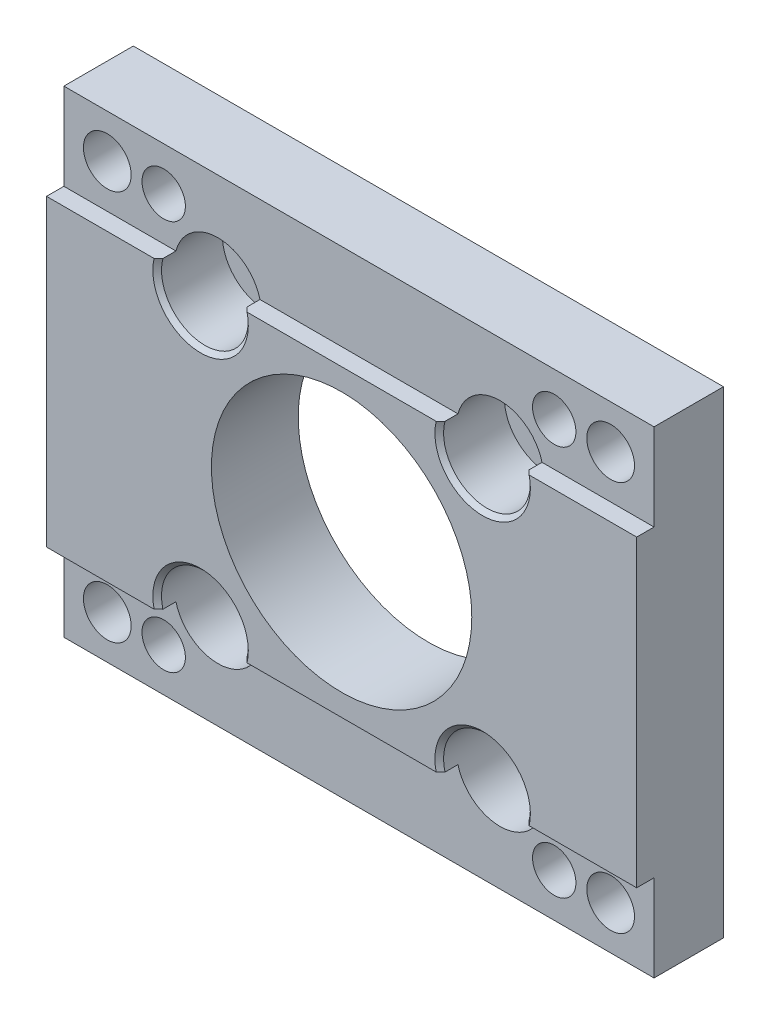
ISO-10303-21;
HEADER;
FILE_DESCRIPTION(('STEP AP214'),'2;1');
FILE_NAME('part.step','',(''),(''),'','','');
FILE_SCHEMA(('AUTOMOTIVE_DESIGN { 1 0 10303 214 1 1 1 1 }'));
ENDSEC;
DATA;
#1=APPLICATION_CONTEXT('core data for automotive mechanical design processes');
#2=APPLICATION_PROTOCOL_DEFINITION('international standard','automotive_design',2000,#1);
#3=PRODUCT_CONTEXT('',#1,'mechanical');
#4=PRODUCT('Part','Part','',(#3));
#5=PRODUCT_RELATED_PRODUCT_CATEGORY('part','',(#4));
#6=PRODUCT_DEFINITION_FORMATION('','',#4);
#7=PRODUCT_DEFINITION_CONTEXT('part definition',#1,'design');
#8=PRODUCT_DEFINITION('design','',#6,#7);
#9=PRODUCT_DEFINITION_SHAPE('','',#8);
#10=(LENGTH_UNIT() NAMED_UNIT(*) SI_UNIT(.MILLI.,.METRE.));
#11=(NAMED_UNIT(*) PLANE_ANGLE_UNIT() SI_UNIT($,.RADIAN.));
#12=(NAMED_UNIT(*) SI_UNIT($,.STERADIAN.) SOLID_ANGLE_UNIT());
#13=UNCERTAINTY_MEASURE_WITH_UNIT(LENGTH_MEASURE(1.E-05),#10,'distance_accuracy_value','');
#14=(GEOMETRIC_REPRESENTATION_CONTEXT(3) GLOBAL_UNCERTAINTY_ASSIGNED_CONTEXT((#13)) GLOBAL_UNIT_ASSIGNED_CONTEXT((#10,
#11,#12)) REPRESENTATION_CONTEXT('',''));
#15=CARTESIAN_POINT('',(0.,0.,0.));
#16=DIRECTION('',(0.,0.,1.));
#17=DIRECTION('',(1.,0.,0.));
#18=AXIS2_PLACEMENT_3D('',#15,#16,#17);
#19=CARTESIAN_POINT('',(-34.,-27.5,10.));
#20=DIRECTION('',(0.,0.,1.));
#21=DIRECTION('',(1.,0.,0.));
#22=AXIS2_PLACEMENT_3D('',#19,#20,#21);
#23=PLANE('',#22);
#24=CARTESIAN_POINT('',(0.,0.,10.));
#25=DIRECTION('',(0.,0.,1.));
#26=DIRECTION('',(1.,0.,0.));
#27=AXIS2_PLACEMENT_3D('',#24,#25,#26);
#28=CIRCLE('',#27,15.);
#29=CARTESIAN_POINT('',(15.,0.,10.));
#30=VERTEX_POINT('',#29);
#31=EDGE_CURVE('E304',#30,#30,#28,.T.);
#32=ORIENTED_EDGE('',*,*,#31,.F.);
#33=EDGE_LOOP('',(#32));
#34=FACE_BOUND('',#33,.T.);
#35=DIRECTION('',(0.,-1.,0.));
#36=VECTOR('',#35,1.);
#37=CARTESIAN_POINT('',(-34.,27.5,10.));
#38=LINE('',#37,#36);
#39=CARTESIAN_POINT('',(-34.,17.5,10.));
#40=VERTEX_POINT('',#39);
#41=CARTESIAN_POINT('',(-34.,-17.5,10.));
#42=VERTEX_POINT('',#41);
#43=EDGE_CURVE('E189',#40,#42,#38,.T.);
#44=ORIENTED_EDGE('',*,*,#43,.T.);
#45=DIRECTION('',(-1.,0.,0.));
#46=VECTOR('',#45,1.);
#47=CARTESIAN_POINT('',(34.,-17.5,10.));
#48=LINE('',#47,#46);
#49=CARTESIAN_POINT('',(-21.6060713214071,-17.5,10.));
#50=VERTEX_POINT('',#49);
#51=EDGE_CURVE('E170',#50,#42,#48,.T.);
#52=ORIENTED_EDGE('',*,*,#51,.F.);
#53=CARTESIAN_POINT('',(-16.25,-16.25,10.));
#54=DIRECTION('',(0.,0.,1.));
#55=DIRECTION('',(1.,0.,0.));
#56=AXIS2_PLACEMENT_3D('',#53,#54,#55);
#57=CIRCLE('',#56,5.5);
#58=CARTESIAN_POINT('',(-10.8939286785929,-17.5,10.));
#59=VERTEX_POINT('',#58);
#60=EDGE_CURVE('E284',#59,#50,#57,.T.);
#61=ORIENTED_EDGE('',*,*,#60,.F.);
#62=CARTESIAN_POINT('',(10.8939286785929,-17.5,10.));
#63=VERTEX_POINT('',#62);
#64=EDGE_CURVE('E182',#63,#59,#48,.T.);
#65=ORIENTED_EDGE('',*,*,#64,.F.);
#66=CARTESIAN_POINT('',(16.25,-16.25,10.));
#67=DIRECTION('',(0.,0.,1.));
#68=DIRECTION('',(1.,0.,0.));
#69=AXIS2_PLACEMENT_3D('',#66,#67,#68);
#70=CIRCLE('',#69,5.5);
#71=CARTESIAN_POINT('',(21.6060713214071,-17.5,10.));
#72=VERTEX_POINT('',#71);
#73=EDGE_CURVE('E243',#72,#63,#70,.T.);
#74=ORIENTED_EDGE('',*,*,#73,.F.);
#75=CARTESIAN_POINT('',(34.,-17.5,10.));
#76=VERTEX_POINT('',#75);
#77=EDGE_CURVE('E185',#76,#72,#48,.T.);
#78=ORIENTED_EDGE('',*,*,#77,.F.);
#79=DIRECTION('',(0.,1.,0.));
#80=VECTOR('',#79,1.);
#81=CARTESIAN_POINT('',(34.,27.5,10.));
#82=LINE('',#81,#80);
#83=CARTESIAN_POINT('',(34.,17.5,10.));
#84=VERTEX_POINT('',#83);
#85=EDGE_CURVE('E196',#76,#84,#82,.T.);
#86=ORIENTED_EDGE('',*,*,#85,.T.);
#87=DIRECTION('',(-1.,0.,0.));
#88=VECTOR('',#87,1.);
#89=CARTESIAN_POINT('',(34.,17.5,10.));
#90=LINE('',#89,#88);
#91=CARTESIAN_POINT('',(21.6060713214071,17.5,10.));
#92=VERTEX_POINT('',#91);
#93=EDGE_CURVE('E218',#84,#92,#90,.T.);
#94=ORIENTED_EDGE('',*,*,#93,.T.);
#95=CARTESIAN_POINT('',(16.25,16.25,10.));
#96=DIRECTION('',(0.,0.,1.));
#97=DIRECTION('',(1.,0.,0.));
#98=AXIS2_PLACEMENT_3D('',#95,#96,#97);
#99=CIRCLE('',#98,5.5);
#100=CARTESIAN_POINT('',(10.8939286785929,17.5,10.));
#101=VERTEX_POINT('',#100);
#102=EDGE_CURVE('E269',#101,#92,#99,.T.);
#103=ORIENTED_EDGE('',*,*,#102,.F.);
#104=CARTESIAN_POINT('',(-10.8939286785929,17.5,10.));
#105=VERTEX_POINT('',#104);
#106=EDGE_CURVE('E440',#101,#105,#90,.T.);
#107=ORIENTED_EDGE('',*,*,#106,.T.);
#108=CARTESIAN_POINT('',(-16.25,16.25,10.));
#109=DIRECTION('',(0.,0.,1.));
#110=DIRECTION('',(1.,0.,0.));
#111=AXIS2_PLACEMENT_3D('',#108,#109,#110);
#112=CIRCLE('',#111,5.5);
#113=CARTESIAN_POINT('',(-21.6060713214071,17.5,10.));
#114=VERTEX_POINT('',#113);
#115=EDGE_CURVE('E298',#114,#105,#112,.T.);
#116=ORIENTED_EDGE('',*,*,#115,.F.);
#117=EDGE_CURVE('E195',#114,#40,#90,.T.);
#118=ORIENTED_EDGE('',*,*,#117,.T.);
#119=EDGE_LOOP('',(#44,#52,#61,#65,#74,#78,#86,#94,#103,#107,#116,#118));
#120=FACE_BOUND('',#119,.T.);
#121=ADVANCED_FACE('F34',(#34,#120),#23,.T.);
#122=CARTESIAN_POINT('',(-34.,27.5,10.));
#123=DIRECTION('',(1.,0.,0.));
#124=DIRECTION('',(0.,0.,-1.));
#125=AXIS2_PLACEMENT_3D('',#122,#123,#124);
#126=PLANE('',#125);
#127=DIRECTION('',(0.,1.,0.));
#128=VECTOR('',#127,1.);
#129=CARTESIAN_POINT('',(-34.,-27.5,8.));
#130=LINE('',#129,#128);
#131=CARTESIAN_POINT('',(-34.,-27.5,8.));
#132=VERTEX_POINT('',#131);
#133=CARTESIAN_POINT('',(-34.,-17.5,8.));
#134=VERTEX_POINT('',#133);
#135=EDGE_CURVE('E191',#132,#134,#130,.T.);
#136=ORIENTED_EDGE('',*,*,#135,.T.);
#137=DIRECTION('',(0.,0.,1.));
#138=VECTOR('',#137,1.);
#139=CARTESIAN_POINT('',(-34.,-17.5,10.));
#140=LINE('',#139,#138);
#141=EDGE_CURVE('E174',#134,#42,#140,.T.);
#142=ORIENTED_EDGE('',*,*,#141,.T.);
#143=ORIENTED_EDGE('',*,*,#43,.F.);
#144=DIRECTION('',(0.,0.,1.));
#145=VECTOR('',#144,1.);
#146=CARTESIAN_POINT('',(-34.,17.5,10.));
#147=LINE('',#146,#145);
#148=CARTESIAN_POINT('',(-34.,17.5,8.));
#149=VERTEX_POINT('',#148);
#150=EDGE_CURVE('E430',#149,#40,#147,.T.);
#151=ORIENTED_EDGE('',*,*,#150,.F.);
#152=DIRECTION('',(0.,-1.,0.));
#153=VECTOR('',#152,1.);
#154=CARTESIAN_POINT('',(-34.,27.5,8.));
#155=LINE('',#154,#153);
#156=CARTESIAN_POINT('',(-34.,27.5,8.));
#157=VERTEX_POINT('',#156);
#158=EDGE_CURVE('E429',#157,#149,#155,.T.);
#159=ORIENTED_EDGE('',*,*,#158,.F.);
#160=DIRECTION('',(0.,0.,-1.));
#161=VECTOR('',#160,1.);
#162=CARTESIAN_POINT('',(-34.,27.5,10.));
#163=LINE('',#162,#161);
#164=CARTESIAN_POINT('',(-34.,27.5,0.));
#165=VERTEX_POINT('',#164);
#166=EDGE_CURVE('E199',#157,#165,#163,.T.);
#167=ORIENTED_EDGE('',*,*,#166,.T.);
#168=DIRECTION('',(0.,-1.,0.));
#169=VECTOR('',#168,1.);
#170=CARTESIAN_POINT('',(-34.,27.5,0.));
#171=LINE('',#170,#169);
#172=CARTESIAN_POINT('',(-34.,-27.5,0.));
#173=VERTEX_POINT('',#172);
#174=EDGE_CURVE('E307',#165,#173,#171,.T.);
#175=ORIENTED_EDGE('',*,*,#174,.T.);
#176=DIRECTION('',(0.,0.,-1.));
#177=VECTOR('',#176,1.);
#178=CARTESIAN_POINT('',(-34.,-27.5,10.));
#179=LINE('',#178,#177);
#180=EDGE_CURVE('E211',#132,#173,#179,.T.);
#181=ORIENTED_EDGE('',*,*,#180,.F.);
#182=EDGE_LOOP('',(#136,#142,#143,#151,#159,#167,#175,#181));
#183=FACE_BOUND('',#182,.T.);
#184=ADVANCED_FACE('F36',(#183),#126,.F.);
#185=CARTESIAN_POINT('',(-34.,-27.5,10.));
#186=DIRECTION('',(0.,1.,0.));
#187=DIRECTION('',(0.,0.,1.));
#188=AXIS2_PLACEMENT_3D('',#185,#186,#187);
#189=PLANE('',#188);
#190=DIRECTION('',(-1.,0.,0.));
#191=VECTOR('',#190,1.);
#192=CARTESIAN_POINT('',(34.,-27.5,8.));
#193=LINE('',#192,#191);
#194=CARTESIAN_POINT('',(34.,-27.5,8.));
#195=VERTEX_POINT('',#194);
#196=EDGE_CURVE('E227',#195,#132,#193,.T.);
#197=ORIENTED_EDGE('',*,*,#196,.T.);
#198=ORIENTED_EDGE('',*,*,#180,.T.);
#199=DIRECTION('',(1.,0.,0.));
#200=VECTOR('',#199,1.);
#201=CARTESIAN_POINT('',(-34.,-27.5,0.));
#202=LINE('',#201,#200);
#203=CARTESIAN_POINT('',(34.,-27.5,0.));
#204=VERTEX_POINT('',#203);
#205=EDGE_CURVE('E310',#173,#204,#202,.T.);
#206=ORIENTED_EDGE('',*,*,#205,.T.);
#207=DIRECTION('',(0.,0.,-1.));
#208=VECTOR('',#207,1.);
#209=CARTESIAN_POINT('',(34.,-27.5,10.));
#210=LINE('',#209,#208);
#211=EDGE_CURVE('E209',#195,#204,#210,.T.);
#212=ORIENTED_EDGE('',*,*,#211,.F.);
#213=EDGE_LOOP('',(#197,#198,#206,#212));
#214=FACE_BOUND('',#213,.T.);
#215=ADVANCED_FACE('F419',(#214),#189,.F.);
#216=CARTESIAN_POINT('',(34.,27.5,10.));
#217=DIRECTION('',(-1.,0.,0.));
#218=DIRECTION('',(0.,0.,1.));
#219=AXIS2_PLACEMENT_3D('',#216,#217,#218);
#220=PLANE('',#219);
#221=DIRECTION('',(0.,1.,0.));
#222=VECTOR('',#221,1.);
#223=CARTESIAN_POINT('',(34.,-27.5,8.));
#224=LINE('',#223,#222);
#225=CARTESIAN_POINT('',(34.,-17.5,8.));
#226=VERTEX_POINT('',#225);
#227=EDGE_CURVE('E183',#195,#226,#224,.T.);
#228=ORIENTED_EDGE('',*,*,#227,.F.);
#229=ORIENTED_EDGE('',*,*,#211,.T.);
#230=DIRECTION('',(0.,1.,0.));
#231=VECTOR('',#230,1.);
#232=CARTESIAN_POINT('',(34.,27.5,0.));
#233=LINE('',#232,#231);
#234=CARTESIAN_POINT('',(34.,27.5,0.));
#235=VERTEX_POINT('',#234);
#236=EDGE_CURVE('E202',#204,#235,#233,.T.);
#237=ORIENTED_EDGE('',*,*,#236,.T.);
#238=DIRECTION('',(0.,0.,-1.));
#239=VECTOR('',#238,1.);
#240=CARTESIAN_POINT('',(34.,27.5,10.));
#241=LINE('',#240,#239);
#242=CARTESIAN_POINT('',(34.,27.5,8.));
#243=VERTEX_POINT('',#242);
#244=EDGE_CURVE('E207',#243,#235,#241,.T.);
#245=ORIENTED_EDGE('',*,*,#244,.F.);
#246=DIRECTION('',(0.,-1.,0.));
#247=VECTOR('',#246,1.);
#248=CARTESIAN_POINT('',(34.,27.5,8.));
#249=LINE('',#248,#247);
#250=CARTESIAN_POINT('',(34.,17.5,8.));
#251=VERTEX_POINT('',#250);
#252=EDGE_CURVE('E339',#243,#251,#249,.T.);
#253=ORIENTED_EDGE('',*,*,#252,.T.);
#254=DIRECTION('',(0.,0.,1.));
#255=VECTOR('',#254,1.);
#256=CARTESIAN_POINT('',(34.,17.5,10.));
#257=LINE('',#256,#255);
#258=EDGE_CURVE('E334',#251,#84,#257,.T.);
#259=ORIENTED_EDGE('',*,*,#258,.T.);
#260=ORIENTED_EDGE('',*,*,#85,.F.);
#261=DIRECTION('',(0.,0.,1.));
#262=VECTOR('',#261,1.);
#263=CARTESIAN_POINT('',(34.,-17.5,10.));
#264=LINE('',#263,#262);
#265=EDGE_CURVE('E694',#226,#76,#264,.T.);
#266=ORIENTED_EDGE('',*,*,#265,.F.);
#267=EDGE_LOOP('',(#228,#229,#237,#245,#253,#259,#260,#266));
#268=FACE_BOUND('',#267,.T.);
#269=ADVANCED_FACE('F318',(#268),#220,.F.);
#270=CARTESIAN_POINT('',(-16.25,-16.25,10.));
#271=DIRECTION('',(0.,0.,1.));
#272=DIRECTION('',(1.,0.,0.));
#273=AXIS2_PLACEMENT_3D('',#270,#271,#272);
#274=CONICAL_SURFACE('',#273,5.5,0.785398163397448);
#275=CARTESIAN_POINT('',(-4.20768693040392,-17.5,16.6070146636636));
#276=CARTESIAN_POINT('',(-4.56315554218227,-17.5,16.2534539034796));
#277=CARTESIAN_POINT('',(-4.91869976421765,-17.5,15.8999691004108));
#278=CARTESIAN_POINT('',(-5.63005576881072,-17.5,15.1931776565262));
#279=CARTESIAN_POINT('',(-5.98586757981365,-17.5,14.8398710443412));
#280=CARTESIAN_POINT('',(-6.69889621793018,-17.5,14.1324494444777));
#281=CARTESIAN_POINT('',(-7.05611396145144,-17.5,13.7783353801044));
#282=CARTESIAN_POINT('',(-7.77092333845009,-17.5,13.0705752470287));
#283=CARTESIAN_POINT('',(-8.1285149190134,-17.5,12.7169291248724));
#284=CARTESIAN_POINT('',(-8.97100659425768,-17.5,11.8851296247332));
#285=CARTESIAN_POINT('',(-9.45615392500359,-17.5,11.4072262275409));
#286=CARTESIAN_POINT('',(-10.1854975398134,-17.5,10.6918105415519));
#287=CARTESIAN_POINT('',(-10.4289363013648,-17.5,10.4535262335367));
#288=CARTESIAN_POINT('',(-10.9165379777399,-17.5,9.97772234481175));
#289=CARTESIAN_POINT('',(-11.1607008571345,-17.5,9.74020272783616));
#290=CARTESIAN_POINT('',(-11.6494545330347,-17.5,9.26694914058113));
#291=CARTESIAN_POINT('',(-11.8940423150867,-17.5,9.03121205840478));
#292=CARTESIAN_POINT('',(-12.3849823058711,-17.5,8.5614846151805));
#293=CARTESIAN_POINT('',(-12.6313348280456,-17.5,8.32749458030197));
#294=CARTESIAN_POINT('',(-13.0030251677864,-17.5,7.97901356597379));
#295=CARTESIAN_POINT('',(-13.1272314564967,-17.5,7.8633169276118));
#296=CARTESIAN_POINT('',(-13.3766926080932,-17.5,7.63306103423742));
#297=CARTESIAN_POINT('',(-13.5019474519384,-17.5,7.51850175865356));
#298=CARTESIAN_POINT('',(-13.753908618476,-17.5,7.29106324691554));
#299=CARTESIAN_POINT('',(-13.8806145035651,-17.5,7.17818352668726));
#300=CARTESIAN_POINT('',(-14.1362103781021,-17.5,6.95493045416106));
#301=CARTESIAN_POINT('',(-14.2651001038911,-17.5,6.84455680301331));
#302=CARTESIAN_POINT('',(-14.4469686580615,-17.5,6.69376840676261));
#303=CARTESIAN_POINT('',(-14.4984874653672,-17.5,6.65159433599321));
#304=CARTESIAN_POINT('',(-14.6021830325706,-17.5,6.56805506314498));
#305=CARTESIAN_POINT('',(-14.6543598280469,-17.5,6.52668990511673));
#306=CARTESIAN_POINT('',(-14.7596255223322,-17.5,6.44489496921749));
#307=CARTESIAN_POINT('',(-14.8127161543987,-17.5,6.40446741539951));
#308=CARTESIAN_POINT('',(-14.9198841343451,-17.5,6.32494288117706));
#309=CARTESIAN_POINT('',(-14.9739614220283,-17.5,6.28584582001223));
#310=CARTESIAN_POINT('',(-15.0822096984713,-17.5,6.21019465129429));
#311=CARTESIAN_POINT('',(-15.1363554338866,-17.5,6.17360460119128));
#312=CARTESIAN_POINT('',(-15.2460979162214,-17.5,6.10267435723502));
#313=CARTESIAN_POINT('',(-15.3016943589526,-17.5,6.06833369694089));
#314=CARTESIAN_POINT('',(-15.4145067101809,-17.5,6.00281244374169));
#315=CARTESIAN_POINT('',(-15.4717170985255,-17.5,5.97162243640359));
#316=CARTESIAN_POINT('',(-15.5882294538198,-17.5,5.91346923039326));
#317=CARTESIAN_POINT('',(-15.6475293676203,-17.5,5.88650201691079));
#318=CARTESIAN_POINT('',(-15.7457430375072,-17.5,5.84743423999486));
#319=CARTESIAN_POINT('',(-15.7839466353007,-17.5,5.83355449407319));
#320=CARTESIAN_POINT('',(-15.8612591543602,-17.5,5.80854185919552));
#321=CARTESIAN_POINT('',(-15.9003681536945,-17.5,5.79740920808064));
#322=CARTESIAN_POINT('',(-15.9791705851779,-17.5,5.77843475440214));
#323=CARTESIAN_POINT('',(-16.0188598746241,-17.5,5.77057599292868));
#324=CARTESIAN_POINT('',(-16.0987860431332,-17.5,5.75849392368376));
#325=CARTESIAN_POINT('',(-16.1390227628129,-17.5,5.75426957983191));
#326=CARTESIAN_POINT('',(-16.2200738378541,-17.5,5.74969800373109));
#327=CARTESIAN_POINT('',(-16.2608901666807,-17.5,5.7493850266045));
#328=CARTESIAN_POINT('',(-16.3423551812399,-17.5,5.7527459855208));
#329=CARTESIAN_POINT('',(-16.3830038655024,-17.5,5.75641995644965));
#330=CARTESIAN_POINT('',(-16.4639321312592,-17.5,5.7675381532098));
#331=CARTESIAN_POINT('',(-16.5042097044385,-17.5,5.77499675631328));
#332=CARTESIAN_POINT('',(-16.5840030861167,-17.5,5.79327002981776));
#333=CARTESIAN_POINT('',(-16.6235184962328,-17.5,5.80408640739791));
#334=CARTESIAN_POINT('',(-16.7229028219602,-17.5,5.83523549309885));
#335=CARTESIAN_POINT('',(-16.7821502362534,-17.5,5.85754415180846));
#336=CARTESIAN_POINT('',(-16.898479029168,-17.5,5.90721360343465));
#337=CARTESIAN_POINT('',(-16.9555586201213,-17.5,5.93457846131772));
#338=CARTESIAN_POINT('',(-17.0680294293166,-17.5,5.99310330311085));
#339=CARTESIAN_POINT('',(-17.1234122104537,-17.5,6.02427929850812));
#340=CARTESIAN_POINT('',(-17.232524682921,-17.5,6.08932018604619));
#341=CARTESIAN_POINT('',(-17.2862550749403,-17.5,6.12318391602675));
#342=CARTESIAN_POINT('',(-17.4026325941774,-17.5,6.19964150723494));
#343=CARTESIAN_POINT('',(-17.4649997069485,-17.5,6.24265906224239));
#344=CARTESIAN_POINT('',(-17.5882750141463,-17.5,6.33074432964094));
#345=CARTESIAN_POINT('',(-17.6491829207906,-17.5,6.37581244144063));
#346=CARTESIAN_POINT('',(-17.7698895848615,-17.5,6.46749138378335));
#347=CARTESIAN_POINT('',(-17.829687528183,-17.5,6.51410328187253));
#348=CARTESIAN_POINT('',(-17.9483709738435,-17.5,6.60847692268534));
#349=CARTESIAN_POINT('',(-18.0072564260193,-17.5,6.65623872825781));
#350=CARTESIAN_POINT('',(-18.1831028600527,-17.5,6.80107050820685));
#351=CARTESIAN_POINT('',(-18.2989698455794,-17.5,6.89946687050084));
#352=CARTESIAN_POINT('',(-18.5287269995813,-17.5,7.09842868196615));
#353=CARTESIAN_POINT('',(-18.6426179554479,-17.5,7.19899322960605));
#354=CARTESIAN_POINT('',(-18.8694890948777,-17.5,7.40200820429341));
#355=CARTESIAN_POINT('',(-18.9824641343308,-17.5,7.5044643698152));
#356=CARTESIAN_POINT('',(-19.2074515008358,-17.5,7.71044833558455));
#357=CARTESIAN_POINT('',(-19.3194637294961,-17.5,7.81397624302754));
#358=CARTESIAN_POINT('',(-19.542593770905,-17.5,8.02164923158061));
#359=CARTESIAN_POINT('',(-19.6537126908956,-17.5,8.12579312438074));
#360=CARTESIAN_POINT('',(-19.8753963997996,-17.5,8.33466092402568));
#361=CARTESIAN_POINT('',(-19.98596120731,-17.5,8.43938481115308));
#362=CARTESIAN_POINT('',(-20.2719619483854,-17.5,8.71137910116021));
#363=CARTESIAN_POINT('',(-20.447071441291,-17.5,8.87899261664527));
#364=CARTESIAN_POINT('',(-20.7965391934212,-17.5,9.21500138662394));
#365=CARTESIAN_POINT('',(-20.9708974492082,-17.5,9.38339664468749));
#366=CARTESIAN_POINT('',(-21.493175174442,-17.5,9.88942147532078));
#367=CARTESIAN_POINT('',(-21.840289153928,-17.5,10.2278820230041));
#368=CARTESIAN_POINT('',(-22.5335481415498,-17.5,10.9062851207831));
#369=CARTESIAN_POINT('',(-22.8796922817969,-17.5,11.246228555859));
#370=CARTESIAN_POINT('',(-23.5712033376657,-17.5,11.9268970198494));
#371=CARTESIAN_POINT('',(-23.9165702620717,-17.5,12.2676220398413));
#372=CARTESIAN_POINT('',(-24.5983615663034,-17.5,12.9412656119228));
#373=CARTESIAN_POINT('',(-24.9347983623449,-17.5,13.2741716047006));
#374=CARTESIAN_POINT('',(-25.6073261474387,-17.5,13.9403351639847));
#375=CARTESIAN_POINT('',(-25.9434171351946,-17.5,14.2735927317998));
#376=CARTESIAN_POINT('',(-26.6150845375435,-17.5,14.9401028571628));
#377=CARTESIAN_POINT('',(-26.9506611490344,-17.5,15.2733552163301));
#378=CARTESIAN_POINT('',(-27.6216188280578,-17.5,15.9400538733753));
#379=CARTESIAN_POINT('',(-27.9569998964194,-17.5,16.2735001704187));
#380=CARTESIAN_POINT('',(-28.2923130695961,-17.5,16.6070146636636));
#381=B_SPLINE_CURVE_WITH_KNOTS('',3,(#275,#276,#277,#278,#279,#280,#281,#282,#283,#284,#285,
#286,#287,#288,#289,#290,#291,#292,#293,#294,#295,#296,#297,#298,#299,#300,#301,#302,#303,#304,
#305,#306,#307,#308,#309,#310,#311,#312,#313,#314,#315,#316,#317,#318,#319,#320,#321,#322,#323,
#324,#325,#326,#327,#328,#329,#330,#331,#332,#333,#334,#335,#336,#337,#338,#339,#340,#341,#342,
#343,#344,#345,#346,#347,#348,#349,#350,#351,#352,#353,#354,#355,#356,#357,#358,#359,#360,#361,
#362,#363,#364,#365,#366,#367,#368,#369,#370,#371,#372,#373,#374,#375,#376,#377,#378,#379,#380),
.UNSPECIFIED.,.F.,.F.,(4,2,2,2,2,2,2,2,2,2,2,2,2,2,2,2,2,2,2,2,2,2,2,2,2,2,2,2,2,2,2,2,2,2,2,2,
2,2,2,2,2,2,2,2,2,2,2,2,2,2,2,2,4),(0.,1.50408391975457,3.0083605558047,4.51733721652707,
6.02612331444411,8.06911594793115,9.09106245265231,10.1129597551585,11.1320519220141,
12.1513298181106,12.6605563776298,13.1697737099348,13.6788413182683,14.1878478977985,
14.3875804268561,14.5873238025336,14.7875005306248,14.9876650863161,15.183674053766,
15.3796422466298,15.5750063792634,15.7701836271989,15.8920406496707,16.0139082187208,
16.1351364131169,16.2563300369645,16.3785843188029,16.5008396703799,16.6235629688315,
16.7463487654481,16.9359288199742,17.1256619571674,17.3162215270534,17.5066991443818,
17.7339315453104,17.9612083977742,18.1886458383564,18.4160957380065,18.8720728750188,
19.3278639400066,19.785396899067,20.2429760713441,20.699854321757,21.1567171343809,
21.883912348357,22.6111108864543,24.0655430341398,25.5210127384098,26.9764659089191,
28.3963758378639,29.8162910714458,31.23510005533,32.6539029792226),.UNSPECIFIED.);
#382=CARTESIAN_POINT('',(-11.4087708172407,-17.5,9.5));
#383=VERTEX_POINT('',#382);
#384=EDGE_CURVE('E432',#59,#383,#381,.T.);
#385=ORIENTED_EDGE('',*,*,#384,.F.);
#386=ORIENTED_EDGE('',*,*,#60,.T.);
#387=CARTESIAN_POINT('',(-21.0912291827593,-17.5,9.5));
#388=VERTEX_POINT('',#387);
#389=EDGE_CURVE('E177',#388,#50,#381,.T.);
#390=ORIENTED_EDGE('',*,*,#389,.F.);
#391=CARTESIAN_POINT('',(-16.25,-16.25,9.5));
#392=DIRECTION('',(0.,0.,1.));
#393=DIRECTION('',(1.,0.,0.));
#394=AXIS2_PLACEMENT_3D('',#391,#392,#393);
#395=CIRCLE('',#394,5.);
#396=EDGE_CURVE('E281',#383,#388,#395,.T.);
#397=ORIENTED_EDGE('',*,*,#396,.F.);
#398=EDGE_LOOP('',(#385,#386,#390,#397));
#399=FACE_BOUND('',#398,.T.);
#400=ADVANCED_FACE('F418',(#399),#274,.F.);
#401=CARTESIAN_POINT('',(-16.25,-16.25,10.));
#402=DIRECTION('',(0.,0.,1.));
#403=DIRECTION('',(1.,0.,0.));
#404=AXIS2_PLACEMENT_3D('',#401,#402,#403);
#405=CYLINDRICAL_SURFACE('',#404,5.);
#406=CARTESIAN_POINT('',(-16.25,-16.25,2.5));
#407=DIRECTION('',(0.,0.,1.));
#408=DIRECTION('',(1.,0.,0.));
#409=AXIS2_PLACEMENT_3D('',#406,#407,#408);
#410=CIRCLE('',#409,5.);
#411=CARTESIAN_POINT('',(-11.25,-16.25,2.5));
#412=VERTEX_POINT('',#411);
#413=EDGE_CURVE('E278',#412,#412,#410,.T.);
#414=ORIENTED_EDGE('',*,*,#413,.F.);
#415=EDGE_LOOP('',(#414));
#416=FACE_BOUND('',#415,.T.);
#417=DIRECTION('',(0.,0.,1.));
#418=VECTOR('',#417,1.);
#419=CARTESIAN_POINT('',(-11.4087708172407,-17.5,10.));
#420=LINE('',#419,#418);
#421=CARTESIAN_POINT('',(-11.4087708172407,-17.5,8.));
#422=VERTEX_POINT('',#421);
#423=EDGE_CURVE('E435',#383,#422,#420,.F.);
#424=ORIENTED_EDGE('',*,*,#423,.F.);
#425=ORIENTED_EDGE('',*,*,#396,.T.);
#426=DIRECTION('',(0.,0.,1.));
#427=VECTOR('',#426,1.);
#428=CARTESIAN_POINT('',(-21.0912291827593,-17.5,10.));
#429=LINE('',#428,#427);
#430=CARTESIAN_POINT('',(-21.0912291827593,-17.5,8.));
#431=VERTEX_POINT('',#430);
#432=EDGE_CURVE('E539',#431,#388,#429,.T.);
#433=ORIENTED_EDGE('',*,*,#432,.F.);
#434=CARTESIAN_POINT('',(-16.25,-16.25,8.));
#435=DIRECTION('',(0.,0.,1.));
#436=DIRECTION('',(0.,-1.,0.));
#437=AXIS2_PLACEMENT_3D('',#434,#435,#436);
#438=CIRCLE('',#437,5.);
#439=EDGE_CURVE('E245',#422,#431,#438,.F.);
#440=ORIENTED_EDGE('',*,*,#439,.F.);
#441=EDGE_LOOP('',(#424,#425,#433,#440));
#442=FACE_BOUND('',#441,.T.);
#443=ADVANCED_FACE('F527',(#416,#442),#405,.F.);
#444=CARTESIAN_POINT('',(16.25,-16.25,10.));
#445=DIRECTION('',(0.,0.,1.));
#446=DIRECTION('',(1.,0.,0.));
#447=AXIS2_PLACEMENT_3D('',#444,#445,#446);
#448=CONICAL_SURFACE('',#447,5.5,0.78539816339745);
#449=CARTESIAN_POINT('',(28.2923130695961,-17.5,16.6070146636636));
#450=CARTESIAN_POINT('',(27.9368444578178,-17.5,16.2534539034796));
#451=CARTESIAN_POINT('',(27.5813002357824,-17.5,15.8999691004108));
#452=CARTESIAN_POINT('',(26.8699442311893,-17.5,15.1931776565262));
#453=CARTESIAN_POINT('',(26.5141324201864,-17.5,14.8398710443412));
#454=CARTESIAN_POINT('',(25.8011037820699,-17.5,14.1324494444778));
#455=CARTESIAN_POINT('',(25.4438860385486,-17.5,13.7783353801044));
#456=CARTESIAN_POINT('',(24.72907666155,-17.5,13.0705752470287));
#457=CARTESIAN_POINT('',(24.3714850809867,-17.5,12.7169291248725));
#458=CARTESIAN_POINT('',(23.5289934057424,-17.5,11.8851296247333));
#459=CARTESIAN_POINT('',(23.0438460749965,-17.5,11.4072262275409));
#460=CARTESIAN_POINT('',(22.3145024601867,-17.5,10.6918105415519));
#461=CARTESIAN_POINT('',(22.0710636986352,-17.5,10.4535262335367));
#462=CARTESIAN_POINT('',(21.5834620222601,-17.5,9.97772234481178));
#463=CARTESIAN_POINT('',(21.3392991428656,-17.5,9.74020272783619));
#464=CARTESIAN_POINT('',(20.8505454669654,-17.5,9.26694914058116));
#465=CARTESIAN_POINT('',(20.6059576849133,-17.5,9.0312120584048));
#466=CARTESIAN_POINT('',(20.1150176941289,-17.5,8.56148461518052));
#467=CARTESIAN_POINT('',(19.8686651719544,-17.5,8.32749458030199));
#468=CARTESIAN_POINT('',(19.4969748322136,-17.5,7.9790135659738));
#469=CARTESIAN_POINT('',(19.3727685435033,-17.5,7.86331692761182));
#470=CARTESIAN_POINT('',(19.1233073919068,-17.5,7.63306103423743));
#471=CARTESIAN_POINT('',(18.9980525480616,-17.5,7.51850175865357));
#472=CARTESIAN_POINT('',(18.746091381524,-17.5,7.29106324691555));
#473=CARTESIAN_POINT('',(18.6193854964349,-17.5,7.17818352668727));
#474=CARTESIAN_POINT('',(18.3637896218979,-17.5,6.95493045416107));
#475=CARTESIAN_POINT('',(18.2348998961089,-17.5,6.84455680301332));
#476=CARTESIAN_POINT('',(18.0530313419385,-17.5,6.69376840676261));
#477=CARTESIAN_POINT('',(18.0015125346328,-17.5,6.65159433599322));
#478=CARTESIAN_POINT('',(17.8978169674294,-17.5,6.56805506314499));
#479=CARTESIAN_POINT('',(17.8456401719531,-17.5,6.52668990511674));
#480=CARTESIAN_POINT('',(17.7403744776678,-17.5,6.44489496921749));
#481=CARTESIAN_POINT('',(17.6872838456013,-17.5,6.40446741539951));
#482=CARTESIAN_POINT('',(17.5801158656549,-17.5,6.32494288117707));
#483=CARTESIAN_POINT('',(17.5260385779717,-17.5,6.28584582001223));
#484=CARTESIAN_POINT('',(17.4177903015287,-17.5,6.2101946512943));
#485=CARTESIAN_POINT('',(17.3636445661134,-17.5,6.17360460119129));
#486=CARTESIAN_POINT('',(17.2539020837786,-17.5,6.10267435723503));
#487=CARTESIAN_POINT('',(17.1983056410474,-17.5,6.0683336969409));
#488=CARTESIAN_POINT('',(17.0854932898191,-17.5,6.0028124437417));
#489=CARTESIAN_POINT('',(17.0282829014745,-17.5,5.9716224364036));
#490=CARTESIAN_POINT('',(16.9117705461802,-17.5,5.91346923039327));
#491=CARTESIAN_POINT('',(16.8524706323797,-17.5,5.8865020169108));
#492=CARTESIAN_POINT('',(16.7542569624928,-17.5,5.84743423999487));
#493=CARTESIAN_POINT('',(16.7160533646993,-17.5,5.8335544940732));
#494=CARTESIAN_POINT('',(16.6387408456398,-17.5,5.80854185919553));
#495=CARTESIAN_POINT('',(16.5996318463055,-17.5,5.79740920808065));
#496=CARTESIAN_POINT('',(16.5208294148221,-17.5,5.77843475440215));
#497=CARTESIAN_POINT('',(16.4811401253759,-17.5,5.77057599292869));
#498=CARTESIAN_POINT('',(16.4012139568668,-17.5,5.75849392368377));
#499=CARTESIAN_POINT('',(16.3609772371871,-17.5,5.75426957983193));
#500=CARTESIAN_POINT('',(16.2799261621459,-17.5,5.74969800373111));
#501=CARTESIAN_POINT('',(16.2391098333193,-17.5,5.74938502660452));
#502=CARTESIAN_POINT('',(16.1576448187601,-17.5,5.75274598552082));
#503=CARTESIAN_POINT('',(16.1169961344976,-17.5,5.75641995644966));
#504=CARTESIAN_POINT('',(16.0360678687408,-17.5,5.76753815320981));
#505=CARTESIAN_POINT('',(15.9957902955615,-17.5,5.7749967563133));
#506=CARTESIAN_POINT('',(15.9159969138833,-17.5,5.79327002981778));
#507=CARTESIAN_POINT('',(15.8764815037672,-17.5,5.80408640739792));
#508=CARTESIAN_POINT('',(15.7770971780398,-17.5,5.83523549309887));
#509=CARTESIAN_POINT('',(15.7178497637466,-17.5,5.85754415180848));
#510=CARTESIAN_POINT('',(15.601520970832,-17.5,5.90721360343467));
#511=CARTESIAN_POINT('',(15.5444413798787,-17.5,5.93457846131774));
#512=CARTESIAN_POINT('',(15.4319705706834,-17.5,5.99310330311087));
#513=CARTESIAN_POINT('',(15.3765877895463,-17.5,6.02427929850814));
#514=CARTESIAN_POINT('',(15.2674753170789,-17.5,6.08932018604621));
#515=CARTESIAN_POINT('',(15.2137449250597,-17.5,6.12318391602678));
#516=CARTESIAN_POINT('',(15.0973674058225,-17.5,6.19964150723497));
#517=CARTESIAN_POINT('',(15.0350002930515,-17.5,6.24265906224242));
#518=CARTESIAN_POINT('',(14.9117249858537,-17.5,6.33074432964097));
#519=CARTESIAN_POINT('',(14.8508170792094,-17.5,6.37581244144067));
#520=CARTESIAN_POINT('',(14.7301104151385,-17.5,6.46749138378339));
#521=CARTESIAN_POINT('',(14.670312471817,-17.5,6.51410328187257));
#522=CARTESIAN_POINT('',(14.5516290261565,-17.5,6.60847692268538));
#523=CARTESIAN_POINT('',(14.4927435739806,-17.5,6.65623872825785));
#524=CARTESIAN_POINT('',(14.3168971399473,-17.5,6.80107050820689));
#525=CARTESIAN_POINT('',(14.2010301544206,-17.5,6.89946687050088));
#526=CARTESIAN_POINT('',(13.9712730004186,-17.5,7.0984286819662));
#527=CARTESIAN_POINT('',(13.8573820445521,-17.5,7.19899322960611));
#528=CARTESIAN_POINT('',(13.6305109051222,-17.5,7.40200820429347));
#529=CARTESIAN_POINT('',(13.5175358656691,-17.5,7.50446436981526));
#530=CARTESIAN_POINT('',(13.2925484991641,-17.5,7.71044833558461));
#531=CARTESIAN_POINT('',(13.1805362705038,-17.5,7.81397624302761));
#532=CARTESIAN_POINT('',(12.9574062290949,-17.5,8.02164923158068));
#533=CARTESIAN_POINT('',(12.8462873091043,-17.5,8.12579312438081));
#534=CARTESIAN_POINT('',(12.6246036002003,-17.5,8.33466092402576));
#535=CARTESIAN_POINT('',(12.5140387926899,-17.5,8.43938481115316));
#536=CARTESIAN_POINT('',(12.2280380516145,-17.5,8.7113791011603));
#537=CARTESIAN_POINT('',(12.0529285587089,-17.5,8.87899261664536));
#538=CARTESIAN_POINT('',(11.7034608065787,-17.5,9.21500138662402));
#539=CARTESIAN_POINT('',(11.5291025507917,-17.5,9.38339664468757));
#540=CARTESIAN_POINT('',(11.0068248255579,-17.5,9.88942147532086));
#541=CARTESIAN_POINT('',(10.6597108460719,-17.5,10.2278820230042));
#542=CARTESIAN_POINT('',(9.96645185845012,-17.5,10.9062851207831));
#543=CARTESIAN_POINT('',(9.62030771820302,-17.5,11.246228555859));
#544=CARTESIAN_POINT('',(8.92879666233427,-17.5,11.9268970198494));
#545=CARTESIAN_POINT('',(8.58342973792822,-17.5,12.2676220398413));
#546=CARTESIAN_POINT('',(7.90163843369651,-17.5,12.9412656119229));
#547=CARTESIAN_POINT('',(7.56520163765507,-17.5,13.2741716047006));
#548=CARTESIAN_POINT('',(6.89267385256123,-17.5,13.9403351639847));
#549=CARTESIAN_POINT('',(6.55658286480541,-17.5,14.2735927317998));
#550=CARTESIAN_POINT('',(5.8849154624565,-17.5,14.9401028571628));
#551=CARTESIAN_POINT('',(5.54933885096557,-17.5,15.2733552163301));
#552=CARTESIAN_POINT('',(4.87838117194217,-17.5,15.9400538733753));
#553=CARTESIAN_POINT('',(4.54300010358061,-17.5,16.2735001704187));
#554=CARTESIAN_POINT('',(4.20768693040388,-17.5,16.6070146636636));
#555=B_SPLINE_CURVE_WITH_KNOTS('',3,(#449,#450,#451,#452,#453,#454,#455,#456,#457,#458,#459,
#460,#461,#462,#463,#464,#465,#466,#467,#468,#469,#470,#471,#472,#473,#474,#475,#476,#477,#478,
#479,#480,#481,#482,#483,#484,#485,#486,#487,#488,#489,#490,#491,#492,#493,#494,#495,#496,#497,
#498,#499,#500,#501,#502,#503,#504,#505,#506,#507,#508,#509,#510,#511,#512,#513,#514,#515,#516,
#517,#518,#519,#520,#521,#522,#523,#524,#525,#526,#527,#528,#529,#530,#531,#532,#533,#534,#535,
#536,#537,#538,#539,#540,#541,#542,#543,#544,#545,#546,#547,#548,#549,#550,#551,#552,#553,#554),
.UNSPECIFIED.,.F.,.F.,(4,2,2,2,2,2,2,2,2,2,2,2,2,2,2,2,2,2,2,2,2,2,2,2,2,2,2,2,2,2,2,2,2,2,2,2,
2,2,2,2,2,2,2,2,2,2,2,2,2,2,2,2,4),(0.,1.50408391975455,3.00836055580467,4.51733721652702,
6.02612331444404,8.06911594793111,9.09106245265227,10.1129597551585,11.1320519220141,
12.1513298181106,12.6605563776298,13.1697737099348,13.6788413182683,14.1878478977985,
14.3875804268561,14.5873238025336,14.7875005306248,14.9876650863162,15.183674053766,
15.3796422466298,15.5750063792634,15.770183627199,15.8920406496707,16.0139082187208,
16.135136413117,16.2563300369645,16.3785843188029,16.5008396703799,16.6235629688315,
16.7463487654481,16.9359288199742,17.1256619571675,17.3162215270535,17.5066991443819,
17.7339315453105,17.9612083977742,18.1886458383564,18.4160957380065,18.8720728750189,
19.3278639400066,19.7853968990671,20.2429760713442,20.6998543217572,21.156717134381,
21.8839123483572,22.6111108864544,24.0655430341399,25.5210127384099,26.9764659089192,
28.396375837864,29.8162910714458,31.2351000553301,32.6539029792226),.UNSPECIFIED.);
#556=CARTESIAN_POINT('',(21.0912291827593,-17.5,9.5));
#557=VERTEX_POINT('',#556);
#558=EDGE_CURVE('E244',#72,#557,#555,.T.);
#559=ORIENTED_EDGE('',*,*,#558,.F.);
#560=ORIENTED_EDGE('',*,*,#73,.T.);
#561=CARTESIAN_POINT('',(11.4087708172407,-17.5,9.5));
#562=VERTEX_POINT('',#561);
#563=EDGE_CURVE('E231',#562,#63,#555,.T.);
#564=ORIENTED_EDGE('',*,*,#563,.F.);
#565=CARTESIAN_POINT('',(16.25,-16.25,9.5));
#566=DIRECTION('',(0.,0.,1.));
#567=DIRECTION('',(1.,0.,0.));
#568=AXIS2_PLACEMENT_3D('',#565,#566,#567);
#569=CIRCLE('',#568,5.);
#570=EDGE_CURVE('E241',#557,#562,#569,.T.);
#571=ORIENTED_EDGE('',*,*,#570,.F.);
#572=EDGE_LOOP('',(#559,#560,#564,#571));
#573=FACE_BOUND('',#572,.T.);
#574=ADVANCED_FACE('F240',(#573),#448,.F.);
#575=CARTESIAN_POINT('',(16.25,-16.25,10.));
#576=DIRECTION('',(0.,0.,1.));
#577=DIRECTION('',(1.,0.,0.));
#578=AXIS2_PLACEMENT_3D('',#575,#576,#577);
#579=CYLINDRICAL_SURFACE('',#578,5.);
#580=CARTESIAN_POINT('',(16.25,-16.25,2.5));
#581=DIRECTION('',(0.,0.,1.));
#582=DIRECTION('',(1.,0.,0.));
#583=AXIS2_PLACEMENT_3D('',#580,#581,#582);
#584=CIRCLE('',#583,5.);
#585=CARTESIAN_POINT('',(21.25,-16.25,2.5));
#586=VERTEX_POINT('',#585);
#587=EDGE_CURVE('E249',#586,#586,#584,.T.);
#588=ORIENTED_EDGE('',*,*,#587,.F.);
#589=EDGE_LOOP('',(#588));
#590=FACE_BOUND('',#589,.T.);
#591=DIRECTION('',(0.,0.,1.));
#592=VECTOR('',#591,1.);
#593=CARTESIAN_POINT('',(21.0912291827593,-17.5,10.));
#594=LINE('',#593,#592);
#595=CARTESIAN_POINT('',(21.0912291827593,-17.5,8.));
#596=VERTEX_POINT('',#595);
#597=EDGE_CURVE('E11',#557,#596,#594,.F.);
#598=ORIENTED_EDGE('',*,*,#597,.F.);
#599=ORIENTED_EDGE('',*,*,#570,.T.);
#600=DIRECTION('',(0.,0.,1.));
#601=VECTOR('',#600,1.);
#602=CARTESIAN_POINT('',(11.4087708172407,-17.5,10.));
#603=LINE('',#602,#601);
#604=CARTESIAN_POINT('',(11.4087708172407,-17.5,8.));
#605=VERTEX_POINT('',#604);
#606=EDGE_CURVE('E42',#605,#562,#603,.T.);
#607=ORIENTED_EDGE('',*,*,#606,.F.);
#608=CARTESIAN_POINT('',(16.25,-16.25,8.));
#609=DIRECTION('',(0.,0.,1.));
#610=DIRECTION('',(0.,-1.,0.));
#611=AXIS2_PLACEMENT_3D('',#608,#609,#610);
#612=CIRCLE('',#611,5.);
#613=EDGE_CURVE('E683',#596,#605,#612,.F.);
#614=ORIENTED_EDGE('',*,*,#613,.F.);
#615=EDGE_LOOP('',(#598,#599,#607,#614));
#616=FACE_BOUND('',#615,.T.);
#617=ADVANCED_FACE('F248',(#590,#616),#579,.F.);
#618=CARTESIAN_POINT('',(-29.,-22.5,0.));
#619=DIRECTION('',(0.,0.,-1.));
#620=DIRECTION('',(-1.,0.,0.));
#621=AXIS2_PLACEMENT_3D('',#618,#619,#620);
#622=CYLINDRICAL_SURFACE('',#621,2.75);
#623=CARTESIAN_POINT('',(-29.,-22.5,0.250000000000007));
#624=DIRECTION('',(0.,0.,-1.));
#625=DIRECTION('',(-1.,0.,0.));
#626=AXIS2_PLACEMENT_3D('',#623,#624,#625);
#627=CIRCLE('',#626,2.75);
#628=CARTESIAN_POINT('',(-31.75,-22.5,0.250000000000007));
#629=VERTEX_POINT('',#628);
#630=EDGE_CURVE('E497',#629,#629,#627,.T.);
#631=ORIENTED_EDGE('',*,*,#630,.T.);
#632=EDGE_LOOP('',(#631));
#633=FACE_BOUND('',#632,.T.);
#634=CARTESIAN_POINT('',(-29.,-22.5,8.));
#635=DIRECTION('',(0.,0.,1.));
#636=DIRECTION('',(0.,-1.,0.));
#637=AXIS2_PLACEMENT_3D('',#634,#635,#636);
#638=CIRCLE('',#637,2.75);
#639=CARTESIAN_POINT('',(-29.,-25.25,8.));
#640=VERTEX_POINT('',#639);
#641=EDGE_CURVE('E677',#640,#640,#638,.F.);
#642=ORIENTED_EDGE('',*,*,#641,.F.);
#643=EDGE_LOOP('',(#642));
#644=FACE_BOUND('',#643,.T.);
#645=ADVANCED_FACE('F518',(#633,#644),#622,.F.);
#646=CARTESIAN_POINT('',(29.,-22.5,0.));
#647=DIRECTION('',(0.,0.,-1.));
#648=DIRECTION('',(-1.,0.,0.));
#649=AXIS2_PLACEMENT_3D('',#646,#647,#648);
#650=CYLINDRICAL_SURFACE('',#649,2.75);
#651=CARTESIAN_POINT('',(29.,-22.5,0.250000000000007));
#652=DIRECTION('',(0.,0.,-1.));
#653=DIRECTION('',(-1.,0.,0.));
#654=AXIS2_PLACEMENT_3D('',#651,#652,#653);
#655=CIRCLE('',#654,2.75);
#656=CARTESIAN_POINT('',(26.25,-22.5,0.250000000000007));
#657=VERTEX_POINT('',#656);
#658=EDGE_CURVE('E485',#657,#657,#655,.T.);
#659=ORIENTED_EDGE('',*,*,#658,.T.);
#660=EDGE_LOOP('',(#659));
#661=FACE_BOUND('',#660,.T.);
#662=CARTESIAN_POINT('',(29.,-22.5,8.));
#663=DIRECTION('',(0.,0.,1.));
#664=DIRECTION('',(0.,-1.,0.));
#665=AXIS2_PLACEMENT_3D('',#662,#663,#664);
#666=CIRCLE('',#665,2.75);
#667=CARTESIAN_POINT('',(29.,-25.25,8.));
#668=VERTEX_POINT('',#667);
#669=EDGE_CURVE('E669',#668,#668,#666,.F.);
#670=ORIENTED_EDGE('',*,*,#669,.F.);
#671=EDGE_LOOP('',(#670));
#672=FACE_BOUND('',#671,.T.);
#673=ADVANCED_FACE('F524',(#661,#672),#650,.F.);
#674=CARTESIAN_POINT('',(-22.5,-22.5,0.));
#675=DIRECTION('',(0.,0.,-1.));
#676=DIRECTION('',(-1.,0.,0.));
#677=AXIS2_PLACEMENT_3D('',#674,#675,#676);
#678=CYLINDRICAL_SURFACE('',#677,2.49999999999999);
#679=CARTESIAN_POINT('',(-22.5,-22.5,0.500000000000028));
#680=DIRECTION('',(0.,0.,-1.));
#681=DIRECTION('',(-1.,0.,0.));
#682=AXIS2_PLACEMENT_3D('',#679,#680,#681);
#683=CIRCLE('',#682,2.49999999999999);
#684=CARTESIAN_POINT('',(-25.,-22.5,0.500000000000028));
#685=VERTEX_POINT('',#684);
#686=EDGE_CURVE('E473',#685,#685,#683,.T.);
#687=ORIENTED_EDGE('',*,*,#686,.T.);
#688=EDGE_LOOP('',(#687));
#689=FACE_BOUND('',#688,.T.);
#690=CARTESIAN_POINT('',(-22.5,-22.5,8.));
#691=DIRECTION('',(0.,0.,1.));
#692=DIRECTION('',(0.,-1.,0.));
#693=AXIS2_PLACEMENT_3D('',#690,#691,#692);
#694=CIRCLE('',#693,2.49999999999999);
#695=CARTESIAN_POINT('',(-22.5,-25.,8.));
#696=VERTEX_POINT('',#695);
#697=EDGE_CURVE('E226',#696,#696,#694,.F.);
#698=ORIENTED_EDGE('',*,*,#697,.F.);
#699=EDGE_LOOP('',(#698));
#700=FACE_BOUND('',#699,.T.);
#701=ADVANCED_FACE('F588',(#689,#700),#678,.F.);
#702=CARTESIAN_POINT('',(22.5,-22.5,0.));
#703=DIRECTION('',(0.,0.,-1.));
#704=DIRECTION('',(-1.,0.,0.));
#705=AXIS2_PLACEMENT_3D('',#702,#703,#704);
#706=CYLINDRICAL_SURFACE('',#705,2.49999999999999);
#707=CARTESIAN_POINT('',(22.5,-22.5,0.500000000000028));
#708=DIRECTION('',(0.,0.,-1.));
#709=DIRECTION('',(-1.,0.,0.));
#710=AXIS2_PLACEMENT_3D('',#707,#708,#709);
#711=CIRCLE('',#710,2.49999999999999);
#712=CARTESIAN_POINT('',(20.,-22.5,0.500000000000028));
#713=VERTEX_POINT('',#712);
#714=EDGE_CURVE('E459',#713,#713,#711,.T.);
#715=ORIENTED_EDGE('',*,*,#714,.T.);
#716=EDGE_LOOP('',(#715));
#717=FACE_BOUND('',#716,.T.);
#718=CARTESIAN_POINT('',(22.5,-22.5,8.));
#719=DIRECTION('',(0.,0.,1.));
#720=DIRECTION('',(0.,-1.,0.));
#721=AXIS2_PLACEMENT_3D('',#718,#719,#720);
#722=CIRCLE('',#721,2.49999999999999);
#723=CARTESIAN_POINT('',(22.5,-25.,8.));
#724=VERTEX_POINT('',#723);
#725=EDGE_CURVE('E224',#724,#724,#722,.F.);
#726=ORIENTED_EDGE('',*,*,#725,.F.);
#727=EDGE_LOOP('',(#726));
#728=FACE_BOUND('',#727,.T.);
#729=ADVANCED_FACE('F410',(#717,#728),#706,.F.);
#730=CARTESIAN_POINT('',(-34.,-27.5,0.));
#731=DIRECTION('',(0.,0.,1.));
#732=DIRECTION('',(1.,0.,0.));
#733=AXIS2_PLACEMENT_3D('',#730,#731,#732);
#734=PLANE('',#733);
#735=CARTESIAN_POINT('',(22.5,22.5,0.));
#736=DIRECTION('',(0.,0.,-1.));
#737=DIRECTION('',(-1.,0.,0.));
#738=AXIS2_PLACEMENT_3D('',#735,#736,#737);
#739=CIRCLE('',#738,3.);
#740=CARTESIAN_POINT('',(19.5,22.5,0.));
#741=VERTEX_POINT('',#740);
#742=EDGE_CURVE('E455',#741,#741,#739,.T.);
#743=ORIENTED_EDGE('',*,*,#742,.F.);
#744=EDGE_LOOP('',(#743));
#745=FACE_BOUND('',#744,.T.);
#746=CARTESIAN_POINT('',(22.5,-22.5,0.));
#747=DIRECTION('',(0.,0.,-1.));
#748=DIRECTION('',(-1.,0.,0.));
#749=AXIS2_PLACEMENT_3D('',#746,#747,#748);
#750=CIRCLE('',#749,3.);
#751=CARTESIAN_POINT('',(19.5,-22.5,0.));
#752=VERTEX_POINT('',#751);
#753=EDGE_CURVE('E464',#752,#752,#750,.T.);
#754=ORIENTED_EDGE('',*,*,#753,.F.);
#755=EDGE_LOOP('',(#754));
#756=FACE_BOUND('',#755,.T.);
#757=CARTESIAN_POINT('',(-22.5,22.5,0.));
#758=DIRECTION('',(0.,0.,-1.));
#759=DIRECTION('',(-1.,0.,0.));
#760=AXIS2_PLACEMENT_3D('',#757,#758,#759);
#761=CIRCLE('',#760,3.);
#762=CARTESIAN_POINT('',(-25.5,22.5,0.));
#763=VERTEX_POINT('',#762);
#764=EDGE_CURVE('E470',#763,#763,#761,.T.);
#765=ORIENTED_EDGE('',*,*,#764,.F.);
#766=EDGE_LOOP('',(#765));
#767=FACE_BOUND('',#766,.T.);
#768=CARTESIAN_POINT('',(-22.5,-22.5,0.));
#769=DIRECTION('',(0.,0.,-1.));
#770=DIRECTION('',(-1.,0.,0.));
#771=AXIS2_PLACEMENT_3D('',#768,#769,#770);
#772=CIRCLE('',#771,3.);
#773=CARTESIAN_POINT('',(-25.5,-22.5,0.));
#774=VERTEX_POINT('',#773);
#775=EDGE_CURVE('E476',#774,#774,#772,.T.);
#776=ORIENTED_EDGE('',*,*,#775,.F.);
#777=EDGE_LOOP('',(#776));
#778=FACE_BOUND('',#777,.T.);
#779=CARTESIAN_POINT('',(29.,22.5,0.));
#780=DIRECTION('',(0.,0.,-1.));
#781=DIRECTION('',(-1.,0.,0.));
#782=AXIS2_PLACEMENT_3D('',#779,#780,#781);
#783=CIRCLE('',#782,3.);
#784=CARTESIAN_POINT('',(26.,22.5,0.));
#785=VERTEX_POINT('',#784);
#786=EDGE_CURVE('E482',#785,#785,#783,.T.);
#787=ORIENTED_EDGE('',*,*,#786,.F.);
#788=EDGE_LOOP('',(#787));
#789=FACE_BOUND('',#788,.T.);
#790=CARTESIAN_POINT('',(29.,-22.5,0.));
#791=DIRECTION('',(0.,0.,-1.));
#792=DIRECTION('',(-1.,0.,0.));
#793=AXIS2_PLACEMENT_3D('',#790,#791,#792);
#794=CIRCLE('',#793,3.);
#795=CARTESIAN_POINT('',(26.,-22.5,0.));
#796=VERTEX_POINT('',#795);
#797=EDGE_CURVE('E488',#796,#796,#794,.T.);
#798=ORIENTED_EDGE('',*,*,#797,.F.);
#799=EDGE_LOOP('',(#798));
#800=FACE_BOUND('',#799,.T.);
#801=CARTESIAN_POINT('',(-29.,22.5,0.));
#802=DIRECTION('',(0.,0.,-1.));
#803=DIRECTION('',(-1.,0.,0.));
#804=AXIS2_PLACEMENT_3D('',#801,#802,#803);
#805=CIRCLE('',#804,3.);
#806=CARTESIAN_POINT('',(-32.,22.5,0.));
#807=VERTEX_POINT('',#806);
#808=EDGE_CURVE('E494',#807,#807,#805,.T.);
#809=ORIENTED_EDGE('',*,*,#808,.F.);
#810=EDGE_LOOP('',(#809));
#811=FACE_BOUND('',#810,.T.);
#812=CARTESIAN_POINT('',(-29.,-22.5,0.));
#813=DIRECTION('',(0.,0.,-1.));
#814=DIRECTION('',(-1.,0.,0.));
#815=AXIS2_PLACEMENT_3D('',#812,#813,#814);
#816=CIRCLE('',#815,3.);
#817=CARTESIAN_POINT('',(-32.,-22.5,0.));
#818=VERTEX_POINT('',#817);
#819=EDGE_CURVE('E500',#818,#818,#816,.T.);
#820=ORIENTED_EDGE('',*,*,#819,.F.);
#821=EDGE_LOOP('',(#820));
#822=FACE_BOUND('',#821,.T.);
#823=CARTESIAN_POINT('',(16.25,-16.25,0.));
#824=DIRECTION('',(0.,0.,1.));
#825=DIRECTION('',(1.,0.,0.));
#826=AXIS2_PLACEMENT_3D('',#823,#824,#825);
#827=CIRCLE('',#826,2.75);
#828=CARTESIAN_POINT('',(19.,-16.25,0.));
#829=VERTEX_POINT('',#828);
#830=EDGE_CURVE('E503',#829,#829,#827,.T.);
#831=ORIENTED_EDGE('',*,*,#830,.T.);
#832=EDGE_LOOP('',(#831));
#833=FACE_BOUND('',#832,.T.);
#834=CARTESIAN_POINT('',(16.25,16.25,0.));
#835=DIRECTION('',(0.,0.,1.));
#836=DIRECTION('',(1.,0.,0.));
#837=AXIS2_PLACEMENT_3D('',#834,#835,#836);
#838=CIRCLE('',#837,2.75);
#839=CARTESIAN_POINT('',(19.,16.25,0.));
#840=VERTEX_POINT('',#839);
#841=EDGE_CURVE('E251',#840,#840,#838,.T.);
#842=ORIENTED_EDGE('',*,*,#841,.T.);
#843=EDGE_LOOP('',(#842));
#844=FACE_BOUND('',#843,.T.);
#845=CARTESIAN_POINT('',(-16.25,-16.25,0.));
#846=DIRECTION('',(0.,0.,1.));
#847=DIRECTION('',(1.,0.,0.));
#848=AXIS2_PLACEMENT_3D('',#845,#846,#847);
#849=CIRCLE('',#848,2.75);
#850=CARTESIAN_POINT('',(-13.5,-16.25,0.));
#851=VERTEX_POINT('',#850);
#852=EDGE_CURVE('E272',#851,#851,#849,.T.);
#853=ORIENTED_EDGE('',*,*,#852,.T.);
#854=EDGE_LOOP('',(#853));
#855=FACE_BOUND('',#854,.T.);
#856=CARTESIAN_POINT('',(-16.25,16.25,0.));
#857=DIRECTION('',(0.,0.,1.));
#858=DIRECTION('',(1.,0.,0.));
#859=AXIS2_PLACEMENT_3D('',#856,#857,#858);
#860=CIRCLE('',#859,2.75);
#861=CARTESIAN_POINT('',(-13.5,16.25,0.));
#862=VERTEX_POINT('',#861);
#863=EDGE_CURVE('E286',#862,#862,#860,.T.);
#864=ORIENTED_EDGE('',*,*,#863,.T.);
#865=EDGE_LOOP('',(#864));
#866=FACE_BOUND('',#865,.T.);
#867=ORIENTED_EDGE('',*,*,#174,.F.);
#868=DIRECTION('',(-1.,0.,0.));
#869=VECTOR('',#868,1.);
#870=CARTESIAN_POINT('',(-34.,27.5,0.));
#871=LINE('',#870,#869);
#872=EDGE_CURVE('E197',#235,#165,#871,.T.);
#873=ORIENTED_EDGE('',*,*,#872,.F.);
#874=ORIENTED_EDGE('',*,*,#236,.F.);
#875=ORIENTED_EDGE('',*,*,#205,.F.);
#876=EDGE_LOOP('',(#867,#873,#874,#875));
#877=FACE_BOUND('',#876,.T.);
#878=CARTESIAN_POINT('',(0.,0.,0.));
#879=DIRECTION('',(0.,0.,1.));
#880=DIRECTION('',(1.,0.,0.));
#881=AXIS2_PLACEMENT_3D('',#878,#879,#880);
#882=CIRCLE('',#881,15.);
#883=CARTESIAN_POINT('',(15.,0.,0.));
#884=VERTEX_POINT('',#883);
#885=EDGE_CURVE('E301',#884,#884,#882,.T.);
#886=ORIENTED_EDGE('',*,*,#885,.T.);
#887=EDGE_LOOP('',(#886));
#888=FACE_BOUND('',#887,.T.);
#889=ADVANCED_FACE('F324',(#745,#756,#767,#778,#789,#800,#811,#822,#833,#844,#855,#866,#877,
#888),#734,.F.);
#890=CARTESIAN_POINT('',(-34.,27.5,10.));
#891=DIRECTION('',(0.,-1.,0.));
#892=DIRECTION('',(0.,0.,-1.));
#893=AXIS2_PLACEMENT_3D('',#890,#891,#892);
#894=PLANE('',#893);
#895=ORIENTED_EDGE('',*,*,#166,.F.);
#896=DIRECTION('',(-1.,0.,0.));
#897=VECTOR('',#896,1.);
#898=CARTESIAN_POINT('',(34.,27.5,8.));
#899=LINE('',#898,#897);
#900=EDGE_CURVE('E330',#243,#157,#899,.T.);
#901=ORIENTED_EDGE('',*,*,#900,.F.);
#902=ORIENTED_EDGE('',*,*,#244,.T.);
#903=ORIENTED_EDGE('',*,*,#872,.T.);
#904=EDGE_LOOP('',(#895,#901,#902,#903));
#905=FACE_BOUND('',#904,.T.);
#906=ADVANCED_FACE('F328',(#905),#894,.F.);
#907=CARTESIAN_POINT('',(0.,0.,10.));
#908=DIRECTION('',(0.,0.,-1.));
#909=DIRECTION('',(-1.,0.,0.));
#910=AXIS2_PLACEMENT_3D('',#907,#908,#909);
#911=CYLINDRICAL_SURFACE('',#910,15.);
#912=ORIENTED_EDGE('',*,*,#31,.T.);
#913=EDGE_LOOP('',(#912));
#914=FACE_BOUND('',#913,.T.);
#915=ORIENTED_EDGE('',*,*,#885,.F.);
#916=EDGE_LOOP('',(#915));
#917=FACE_BOUND('',#916,.T.);
#918=ADVANCED_FACE('F402',(#914,#917),#911,.F.);
#919=CARTESIAN_POINT('',(-16.25,16.25,10.));
#920=DIRECTION('',(0.,0.,1.));
#921=DIRECTION('',(1.,0.,0.));
#922=AXIS2_PLACEMENT_3D('',#919,#920,#921);
#923=CONICAL_SURFACE('',#922,5.5,0.785398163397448);
#924=ORIENTED_EDGE('',*,*,#115,.T.);
#925=CARTESIAN_POINT('',(-4.20768693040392,17.5,16.6070146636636));
#926=CARTESIAN_POINT('',(-4.56315554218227,17.5,16.2534539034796));
#927=CARTESIAN_POINT('',(-4.91869976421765,17.5,15.8999691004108));
#928=CARTESIAN_POINT('',(-5.63005576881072,17.5,15.1931776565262));
#929=CARTESIAN_POINT('',(-5.98586757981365,17.5,14.8398710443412));
#930=CARTESIAN_POINT('',(-6.69889621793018,17.5,14.1324494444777));
#931=CARTESIAN_POINT('',(-7.05611396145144,17.5,13.7783353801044));
#932=CARTESIAN_POINT('',(-7.77092333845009,17.5,13.0705752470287));
#933=CARTESIAN_POINT('',(-8.1285149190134,17.5,12.7169291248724));
#934=CARTESIAN_POINT('',(-8.97100659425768,17.5,11.8851296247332));
#935=CARTESIAN_POINT('',(-9.45615392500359,17.5,11.4072262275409));
#936=CARTESIAN_POINT('',(-10.1854975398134,17.5,10.6918105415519));
#937=CARTESIAN_POINT('',(-10.4289363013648,17.5,10.4535262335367));
#938=CARTESIAN_POINT('',(-10.9165379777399,17.5,9.97772234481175));
#939=CARTESIAN_POINT('',(-11.1607008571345,17.5,9.74020272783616));
#940=CARTESIAN_POINT('',(-11.6494545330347,17.5,9.26694914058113));
#941=CARTESIAN_POINT('',(-11.8940423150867,17.5,9.03121205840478));
#942=CARTESIAN_POINT('',(-12.3849823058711,17.5,8.5614846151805));
#943=CARTESIAN_POINT('',(-12.6313348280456,17.5,8.32749458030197));
#944=CARTESIAN_POINT('',(-13.0030251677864,17.5,7.97901356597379));
#945=CARTESIAN_POINT('',(-13.1272314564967,17.5,7.8633169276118));
#946=CARTESIAN_POINT('',(-13.3766926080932,17.5,7.63306103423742));
#947=CARTESIAN_POINT('',(-13.5019474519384,17.5,7.51850175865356));
#948=CARTESIAN_POINT('',(-13.753908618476,17.5,7.29106324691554));
#949=CARTESIAN_POINT('',(-13.8806145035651,17.5,7.17818352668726));
#950=CARTESIAN_POINT('',(-14.1362103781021,17.5,6.95493045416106));
#951=CARTESIAN_POINT('',(-14.2651001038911,17.5,6.84455680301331));
#952=CARTESIAN_POINT('',(-14.4469686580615,17.5,6.69376840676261));
#953=CARTESIAN_POINT('',(-14.4984874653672,17.5,6.65159433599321));
#954=CARTESIAN_POINT('',(-14.6021830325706,17.5,6.56805506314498));
#955=CARTESIAN_POINT('',(-14.6543598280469,17.5,6.52668990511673));
#956=CARTESIAN_POINT('',(-14.7596255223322,17.5,6.44489496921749));
#957=CARTESIAN_POINT('',(-14.8127161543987,17.5,6.40446741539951));
#958=CARTESIAN_POINT('',(-14.9198841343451,17.5,6.32494288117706));
#959=CARTESIAN_POINT('',(-14.9739614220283,17.5,6.28584582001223));
#960=CARTESIAN_POINT('',(-15.0822096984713,17.5,6.21019465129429));
#961=CARTESIAN_POINT('',(-15.1363554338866,17.5,6.17360460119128));
#962=CARTESIAN_POINT('',(-15.2460979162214,17.5,6.10267435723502));
#963=CARTESIAN_POINT('',(-15.3016943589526,17.5,6.06833369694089));
#964=CARTESIAN_POINT('',(-15.4145067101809,17.5,6.00281244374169));
#965=CARTESIAN_POINT('',(-15.4717170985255,17.5,5.97162243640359));
#966=CARTESIAN_POINT('',(-15.5882294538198,17.5,5.91346923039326));
#967=CARTESIAN_POINT('',(-15.6475293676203,17.5,5.88650201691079));
#968=CARTESIAN_POINT('',(-15.7457430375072,17.5,5.84743423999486));
#969=CARTESIAN_POINT('',(-15.7839466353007,17.5,5.83355449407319));
#970=CARTESIAN_POINT('',(-15.8612591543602,17.5,5.80854185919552));
#971=CARTESIAN_POINT('',(-15.9003681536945,17.5,5.79740920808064));
#972=CARTESIAN_POINT('',(-15.9791705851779,17.5,5.77843475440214));
#973=CARTESIAN_POINT('',(-16.0188598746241,17.5,5.77057599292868));
#974=CARTESIAN_POINT('',(-16.0987860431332,17.5,5.75849392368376));
#975=CARTESIAN_POINT('',(-16.1390227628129,17.5,5.75426957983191));
#976=CARTESIAN_POINT('',(-16.2200738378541,17.5,5.74969800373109));
#977=CARTESIAN_POINT('',(-16.2608901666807,17.5,5.7493850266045));
#978=CARTESIAN_POINT('',(-16.3423551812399,17.5,5.7527459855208));
#979=CARTESIAN_POINT('',(-16.3830038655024,17.5,5.75641995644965));
#980=CARTESIAN_POINT('',(-16.4639321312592,17.5,5.7675381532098));
#981=CARTESIAN_POINT('',(-16.5042097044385,17.5,5.77499675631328));
#982=CARTESIAN_POINT('',(-16.5840030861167,17.5,5.79327002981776));
#983=CARTESIAN_POINT('',(-16.6235184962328,17.5,5.80408640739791));
#984=CARTESIAN_POINT('',(-16.7229028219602,17.5,5.83523549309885));
#985=CARTESIAN_POINT('',(-16.7821502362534,17.5,5.85754415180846));
#986=CARTESIAN_POINT('',(-16.898479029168,17.5,5.90721360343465));
#987=CARTESIAN_POINT('',(-16.9555586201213,17.5,5.93457846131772));
#988=CARTESIAN_POINT('',(-17.0680294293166,17.5,5.99310330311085));
#989=CARTESIAN_POINT('',(-17.1234122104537,17.5,6.02427929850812));
#990=CARTESIAN_POINT('',(-17.232524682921,17.5,6.08932018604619));
#991=CARTESIAN_POINT('',(-17.2862550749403,17.5,6.12318391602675));
#992=CARTESIAN_POINT('',(-17.4026325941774,17.5,6.19964150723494));
#993=CARTESIAN_POINT('',(-17.4649997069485,17.5,6.2426590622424));
#994=CARTESIAN_POINT('',(-17.5882750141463,17.5,6.33074432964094));
#995=CARTESIAN_POINT('',(-17.6491829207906,17.5,6.37581244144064));
#996=CARTESIAN_POINT('',(-17.7698895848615,17.5,6.46749138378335));
#997=CARTESIAN_POINT('',(-17.829687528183,17.5,6.51410328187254));
#998=CARTESIAN_POINT('',(-17.9483709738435,17.5,6.60847692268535));
#999=CARTESIAN_POINT('',(-18.0072564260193,17.5,6.65623872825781));
#1000=CARTESIAN_POINT('',(-18.1831028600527,17.5,6.80107050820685));
#1001=CARTESIAN_POINT('',(-18.2989698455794,17.5,6.89946687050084));
#1002=CARTESIAN_POINT('',(-18.5287269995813,17.5,7.09842868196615));
#1003=CARTESIAN_POINT('',(-18.6426179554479,17.5,7.19899322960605));
#1004=CARTESIAN_POINT('',(-18.8694890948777,17.5,7.40200820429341));
#1005=CARTESIAN_POINT('',(-18.9824641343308,17.5,7.5044643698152));
#1006=CARTESIAN_POINT('',(-19.2074515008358,17.5,7.71044833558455));
#1007=CARTESIAN_POINT('',(-19.3194637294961,17.5,7.81397624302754));
#1008=CARTESIAN_POINT('',(-19.542593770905,17.5,8.02164923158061));
#1009=CARTESIAN_POINT('',(-19.6537126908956,17.5,8.12579312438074));
#1010=CARTESIAN_POINT('',(-19.8753963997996,17.5,8.33466092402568));
#1011=CARTESIAN_POINT('',(-19.98596120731,17.5,8.43938481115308));
#1012=CARTESIAN_POINT('',(-20.2719619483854,17.5,8.71137910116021));
#1013=CARTESIAN_POINT('',(-20.447071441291,17.5,8.87899261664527));
#1014=CARTESIAN_POINT('',(-20.7965391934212,17.5,9.21500138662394));
#1015=CARTESIAN_POINT('',(-20.9708974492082,17.5,9.38339664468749));
#1016=CARTESIAN_POINT('',(-21.493175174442,17.5,9.88942147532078));
#1017=CARTESIAN_POINT('',(-21.840289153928,17.5,10.2278820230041));
#1018=CARTESIAN_POINT('',(-22.5335481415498,17.5,10.9062851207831));
#1019=CARTESIAN_POINT('',(-22.8796922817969,17.5,11.246228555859));
#1020=CARTESIAN_POINT('',(-23.5712033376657,17.5,11.9268970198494));
#1021=CARTESIAN_POINT('',(-23.9165702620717,17.5,12.2676220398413));
#1022=CARTESIAN_POINT('',(-24.5983615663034,17.5,12.9412656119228));
#1023=CARTESIAN_POINT('',(-24.9347983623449,17.5,13.2741716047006));
#1024=CARTESIAN_POINT('',(-25.6073261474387,17.5,13.9403351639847));
#1025=CARTESIAN_POINT('',(-25.9434171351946,17.5,14.2735927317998));
#1026=CARTESIAN_POINT('',(-26.6150845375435,17.5,14.9401028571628));
#1027=CARTESIAN_POINT('',(-26.9506611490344,17.5,15.2733552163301));
#1028=CARTESIAN_POINT('',(-27.6216188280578,17.5,15.9400538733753));
#1029=CARTESIAN_POINT('',(-27.9569998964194,17.5,16.2735001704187));
#1030=CARTESIAN_POINT('',(-28.2923130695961,17.5,16.6070146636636));
#1031=B_SPLINE_CURVE_WITH_KNOTS('',3,(#925,#926,#927,#928,#929,#930,#931,#932,#933,#934,#935,
#936,#937,#938,#939,#940,#941,#942,#943,#944,#945,#946,#947,#948,#949,#950,#951,#952,#953,#954,
#955,#956,#957,#958,#959,#960,#961,#962,#963,#964,#965,#966,#967,#968,#969,#970,#971,#972,#973,
#974,#975,#976,#977,#978,#979,#980,#981,#982,#983,#984,#985,#986,#987,#988,#989,#990,#991,#992,
#993,#994,#995,#996,#997,#998,#999,#1000,#1001,#1002,#1003,#1004,#1005,#1006,#1007,#1008,#1009,
#1010,#1011,#1012,#1013,#1014,#1015,#1016,#1017,#1018,#1019,#1020,#1021,#1022,#1023,#1024,#1025,
#1026,#1027,#1028,#1029,#1030),.UNSPECIFIED.,.F.,.F.,(4,2,2,2,2,2,2,2,2,2,2,2,2,2,2,2,2,2,2,2,2,
2,2,2,2,2,2,2,2,2,2,2,2,2,2,2,2,2,2,2,2,2,2,2,2,2,2,2,2,2,2,2,4),(0.,1.50408391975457,
3.0083605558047,4.51733721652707,6.02612331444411,8.06911594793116,9.09106245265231,
10.1129597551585,11.1320519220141,12.1513298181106,12.6605563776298,13.1697737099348,
13.6788413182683,14.1878478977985,14.3875804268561,14.5873238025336,14.7875005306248,
14.9876650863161,15.183674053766,15.3796422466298,15.5750063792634,15.7701836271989,
15.8920406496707,16.0139082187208,16.135136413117,16.2563300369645,16.3785843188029,
16.5008396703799,16.6235629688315,16.7463487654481,16.9359288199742,17.1256619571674,
17.3162215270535,17.5066991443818,17.7339315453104,17.9612083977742,18.1886458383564,
18.4160957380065,18.8720728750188,19.3278639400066,19.785396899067,20.2429760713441,
20.699854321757,21.1567171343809,21.8839123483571,22.6111108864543,24.0655430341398,
25.5210127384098,26.9764659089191,28.3963758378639,29.8162910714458,31.23510005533,
32.6539029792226),.UNSPECIFIED.);
#1032=CARTESIAN_POINT('',(-11.4087708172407,17.5,9.5));
#1033=VERTEX_POINT('',#1032);
#1034=EDGE_CURVE('E394',#105,#1033,#1031,.T.);
#1035=ORIENTED_EDGE('',*,*,#1034,.T.);
#1036=CARTESIAN_POINT('',(-16.25,16.25,9.5));
#1037=DIRECTION('',(0.,0.,1.));
#1038=DIRECTION('',(1.,0.,0.));
#1039=AXIS2_PLACEMENT_3D('',#1036,#1037,#1038);
#1040=CIRCLE('',#1039,5.);
#1041=CARTESIAN_POINT('',(-21.0912291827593,17.5,9.5));
#1042=VERTEX_POINT('',#1041);
#1043=EDGE_CURVE('E295',#1042,#1033,#1040,.T.);
#1044=ORIENTED_EDGE('',*,*,#1043,.F.);
#1045=EDGE_CURVE('E386',#1042,#114,#1031,.T.);
#1046=ORIENTED_EDGE('',*,*,#1045,.T.);
#1047=EDGE_LOOP('',(#924,#1035,#1044,#1046));
#1048=FACE_BOUND('',#1047,.T.);
#1049=ADVANCED_FACE('F396',(#1048),#923,.F.);
#1050=CARTESIAN_POINT('',(-16.25,16.25,10.));
#1051=DIRECTION('',(0.,0.,1.));
#1052=DIRECTION('',(1.,0.,0.));
#1053=AXIS2_PLACEMENT_3D('',#1050,#1051,#1052);
#1054=CYLINDRICAL_SURFACE('',#1053,5.);
#1055=ORIENTED_EDGE('',*,*,#1043,.T.);
#1056=DIRECTION('',(0.,0.,1.));
#1057=VECTOR('',#1056,1.);
#1058=CARTESIAN_POINT('',(-11.4087708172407,17.5,10.));
#1059=LINE('',#1058,#1057);
#1060=CARTESIAN_POINT('',(-11.4087708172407,17.5,8.));
#1061=VERTEX_POINT('',#1060);
#1062=EDGE_CURVE('E393',#1033,#1061,#1059,.F.);
#1063=ORIENTED_EDGE('',*,*,#1062,.T.);
#1064=CARTESIAN_POINT('',(-16.25,16.25,8.));
#1065=DIRECTION('',(0.,0.,-1.));
#1066=DIRECTION('',(0.,1.,0.));
#1067=AXIS2_PLACEMENT_3D('',#1064,#1065,#1066);
#1068=CIRCLE('',#1067,5.);
#1069=CARTESIAN_POINT('',(-21.0912291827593,17.5,8.));
#1070=VERTEX_POINT('',#1069);
#1071=EDGE_CURVE('E354',#1061,#1070,#1068,.F.);
#1072=ORIENTED_EDGE('',*,*,#1071,.T.);
#1073=DIRECTION('',(0.,0.,1.));
#1074=VECTOR('',#1073,1.);
#1075=CARTESIAN_POINT('',(-21.0912291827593,17.5,10.));
#1076=LINE('',#1075,#1074);
#1077=EDGE_CURVE('E366',#1070,#1042,#1076,.T.);
#1078=ORIENTED_EDGE('',*,*,#1077,.T.);
#1079=EDGE_LOOP('',(#1055,#1063,#1072,#1078));
#1080=FACE_BOUND('',#1079,.T.);
#1081=CARTESIAN_POINT('',(-16.25,16.25,2.5));
#1082=DIRECTION('',(0.,0.,1.));
#1083=DIRECTION('',(1.,0.,0.));
#1084=AXIS2_PLACEMENT_3D('',#1081,#1082,#1083);
#1085=CIRCLE('',#1084,5.);
#1086=CARTESIAN_POINT('',(-11.25,16.25,2.5));
#1087=VERTEX_POINT('',#1086);
#1088=EDGE_CURVE('E292',#1087,#1087,#1085,.T.);
#1089=ORIENTED_EDGE('',*,*,#1088,.F.);
#1090=EDGE_LOOP('',(#1089));
#1091=FACE_BOUND('',#1090,.T.);
#1092=ADVANCED_FACE('F401',(#1080,#1091),#1054,.F.);
#1093=CARTESIAN_POINT('',(-11.25,16.25,2.5));
#1094=DIRECTION('',(0.,0.,-1.));
#1095=DIRECTION('',(-1.,0.,0.));
#1096=AXIS2_PLACEMENT_3D('',#1093,#1094,#1095);
#1097=PLANE('',#1096);
#1098=CARTESIAN_POINT('',(-16.25,16.25,2.5));
#1099=DIRECTION('',(0.,0.,1.));
#1100=DIRECTION('',(1.,0.,0.));
#1101=AXIS2_PLACEMENT_3D('',#1098,#1099,#1100);
#1102=CIRCLE('',#1101,2.75);
#1103=CARTESIAN_POINT('',(-13.5,16.25,2.5));
#1104=VERTEX_POINT('',#1103);
#1105=EDGE_CURVE('E289',#1104,#1104,#1102,.T.);
#1106=ORIENTED_EDGE('',*,*,#1105,.F.);
#1107=EDGE_LOOP('',(#1106));
#1108=FACE_BOUND('',#1107,.T.);
#1109=ORIENTED_EDGE('',*,*,#1088,.T.);
#1110=EDGE_LOOP('',(#1109));
#1111=FACE_BOUND('',#1110,.T.);
#1112=ADVANCED_FACE('F553',(#1108,#1111),#1097,.F.);
#1113=CARTESIAN_POINT('',(-16.25,16.25,10.));
#1114=DIRECTION('',(0.,0.,1.));
#1115=DIRECTION('',(1.,0.,0.));
#1116=AXIS2_PLACEMENT_3D('',#1113,#1114,#1115);
#1117=CYLINDRICAL_SURFACE('',#1116,2.75);
#1118=ORIENTED_EDGE('',*,*,#863,.F.);
#1119=EDGE_LOOP('',(#1118));
#1120=FACE_BOUND('',#1119,.T.);
#1121=ORIENTED_EDGE('',*,*,#1105,.T.);
#1122=EDGE_LOOP('',(#1121));
#1123=FACE_BOUND('',#1122,.T.);
#1124=ADVANCED_FACE('F550',(#1120,#1123),#1117,.F.);
#1125=CARTESIAN_POINT('',(-11.25,-16.25,2.5));
#1126=DIRECTION('',(0.,0.,-1.));
#1127=DIRECTION('',(-1.,0.,0.));
#1128=AXIS2_PLACEMENT_3D('',#1125,#1126,#1127);
#1129=PLANE('',#1128);
#1130=CARTESIAN_POINT('',(-16.25,-16.25,2.5));
#1131=DIRECTION('',(0.,0.,1.));
#1132=DIRECTION('',(1.,0.,0.));
#1133=AXIS2_PLACEMENT_3D('',#1130,#1131,#1132);
#1134=CIRCLE('',#1133,2.75);
#1135=CARTESIAN_POINT('',(-13.5,-16.25,2.5));
#1136=VERTEX_POINT('',#1135);
#1137=EDGE_CURVE('E275',#1136,#1136,#1134,.T.);
#1138=ORIENTED_EDGE('',*,*,#1137,.F.);
#1139=EDGE_LOOP('',(#1138));
#1140=FACE_BOUND('',#1139,.T.);
#1141=ORIENTED_EDGE('',*,*,#413,.T.);
#1142=EDGE_LOOP('',(#1141));
#1143=FACE_BOUND('',#1142,.T.);
#1144=ADVANCED_FACE('F552',(#1140,#1143),#1129,.F.);
#1145=CARTESIAN_POINT('',(-16.25,-16.25,10.));
#1146=DIRECTION('',(0.,0.,1.));
#1147=DIRECTION('',(1.,0.,0.));
#1148=AXIS2_PLACEMENT_3D('',#1145,#1146,#1147);
#1149=CYLINDRICAL_SURFACE('',#1148,2.75);
#1150=ORIENTED_EDGE('',*,*,#852,.F.);
#1151=EDGE_LOOP('',(#1150));
#1152=FACE_BOUND('',#1151,.T.);
#1153=ORIENTED_EDGE('',*,*,#1137,.T.);
#1154=EDGE_LOOP('',(#1153));
#1155=FACE_BOUND('',#1154,.T.);
#1156=ADVANCED_FACE('F742',(#1152,#1155),#1149,.F.);
#1157=CARTESIAN_POINT('',(16.25,16.25,10.));
#1158=DIRECTION('',(0.,0.,1.));
#1159=DIRECTION('',(1.,0.,0.));
#1160=AXIS2_PLACEMENT_3D('',#1157,#1158,#1159);
#1161=CONICAL_SURFACE('',#1160,5.5,0.78539816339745);
#1162=ORIENTED_EDGE('',*,*,#102,.T.);
#1163=CARTESIAN_POINT('',(28.2923130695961,17.5,16.6070146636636));
#1164=CARTESIAN_POINT('',(27.9368444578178,17.5,16.2534539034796));
#1165=CARTESIAN_POINT('',(27.5813002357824,17.5,15.8999691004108));
#1166=CARTESIAN_POINT('',(26.8699442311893,17.5,15.1931776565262));
#1167=CARTESIAN_POINT('',(26.5141324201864,17.5,14.8398710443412));
#1168=CARTESIAN_POINT('',(25.8011037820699,17.5,14.1324494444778));
#1169=CARTESIAN_POINT('',(25.4438860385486,17.5,13.7783353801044));
#1170=CARTESIAN_POINT('',(24.72907666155,17.5,13.0705752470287));
#1171=CARTESIAN_POINT('',(24.3714850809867,17.5,12.7169291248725));
#1172=CARTESIAN_POINT('',(23.5289934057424,17.5,11.8851296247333));
#1173=CARTESIAN_POINT('',(23.0438460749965,17.5,11.4072262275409));
#1174=CARTESIAN_POINT('',(22.3145024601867,17.5,10.6918105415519));
#1175=CARTESIAN_POINT('',(22.0710636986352,17.5,10.4535262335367));
#1176=CARTESIAN_POINT('',(21.5834620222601,17.5,9.97772234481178));
#1177=CARTESIAN_POINT('',(21.3392991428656,17.5,9.74020272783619));
#1178=CARTESIAN_POINT('',(20.8505454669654,17.5,9.26694914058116));
#1179=CARTESIAN_POINT('',(20.6059576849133,17.5,9.0312120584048));
#1180=CARTESIAN_POINT('',(20.1150176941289,17.5,8.56148461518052));
#1181=CARTESIAN_POINT('',(19.8686651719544,17.5,8.32749458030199));
#1182=CARTESIAN_POINT('',(19.4969748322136,17.5,7.9790135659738));
#1183=CARTESIAN_POINT('',(19.3727685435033,17.5,7.86331692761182));
#1184=CARTESIAN_POINT('',(19.1233073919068,17.5,7.63306103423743));
#1185=CARTESIAN_POINT('',(18.9980525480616,17.5,7.51850175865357));
#1186=CARTESIAN_POINT('',(18.746091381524,17.5,7.29106324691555));
#1187=CARTESIAN_POINT('',(18.6193854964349,17.5,7.17818352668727));
#1188=CARTESIAN_POINT('',(18.3637896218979,17.5,6.95493045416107));
#1189=CARTESIAN_POINT('',(18.2348998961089,17.5,6.84455680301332));
#1190=CARTESIAN_POINT('',(18.0530313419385,17.5,6.69376840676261));
#1191=CARTESIAN_POINT('',(18.0015125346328,17.5,6.65159433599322));
#1192=CARTESIAN_POINT('',(17.8978169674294,17.5,6.56805506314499));
#1193=CARTESIAN_POINT('',(17.8456401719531,17.5,6.52668990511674));
#1194=CARTESIAN_POINT('',(17.7403744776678,17.5,6.44489496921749));
#1195=CARTESIAN_POINT('',(17.6872838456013,17.5,6.40446741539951));
#1196=CARTESIAN_POINT('',(17.5801158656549,17.5,6.32494288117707));
#1197=CARTESIAN_POINT('',(17.5260385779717,17.5,6.28584582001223));
#1198=CARTESIAN_POINT('',(17.4177903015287,17.5,6.2101946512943));
#1199=CARTESIAN_POINT('',(17.3636445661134,17.5,6.17360460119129));
#1200=CARTESIAN_POINT('',(17.2539020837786,17.5,6.10267435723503));
#1201=CARTESIAN_POINT('',(17.1983056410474,17.5,6.0683336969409));
#1202=CARTESIAN_POINT('',(17.0854932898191,17.5,6.0028124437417));
#1203=CARTESIAN_POINT('',(17.0282829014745,17.5,5.9716224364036));
#1204=CARTESIAN_POINT('',(16.9117705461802,17.5,5.91346923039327));
#1205=CARTESIAN_POINT('',(16.8524706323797,17.5,5.8865020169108));
#1206=CARTESIAN_POINT('',(16.7542569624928,17.5,5.84743423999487));
#1207=CARTESIAN_POINT('',(16.7160533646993,17.5,5.8335544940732));
#1208=CARTESIAN_POINT('',(16.6387408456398,17.5,5.80854185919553));
#1209=CARTESIAN_POINT('',(16.5996318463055,17.5,5.79740920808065));
#1210=CARTESIAN_POINT('',(16.5208294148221,17.5,5.77843475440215));
#1211=CARTESIAN_POINT('',(16.4811401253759,17.5,5.77057599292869));
#1212=CARTESIAN_POINT('',(16.4012139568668,17.5,5.75849392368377));
#1213=CARTESIAN_POINT('',(16.3609772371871,17.5,5.75426957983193));
#1214=CARTESIAN_POINT('',(16.2799261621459,17.5,5.74969800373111));
#1215=CARTESIAN_POINT('',(16.2391098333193,17.5,5.74938502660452));
#1216=CARTESIAN_POINT('',(16.1576448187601,17.5,5.75274598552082));
#1217=CARTESIAN_POINT('',(16.1169961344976,17.5,5.75641995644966));
#1218=CARTESIAN_POINT('',(16.0360678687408,17.5,5.76753815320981));
#1219=CARTESIAN_POINT('',(15.9957902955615,17.5,5.7749967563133));
#1220=CARTESIAN_POINT('',(15.9159969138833,17.5,5.79327002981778));
#1221=CARTESIAN_POINT('',(15.8764815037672,17.5,5.80408640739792));
#1222=CARTESIAN_POINT('',(15.7770971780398,17.5,5.83523549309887));
#1223=CARTESIAN_POINT('',(15.7178497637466,17.5,5.85754415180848));
#1224=CARTESIAN_POINT('',(15.601520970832,17.5,5.90721360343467));
#1225=CARTESIAN_POINT('',(15.5444413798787,17.5,5.93457846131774));
#1226=CARTESIAN_POINT('',(15.4319705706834,17.5,5.99310330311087));
#1227=CARTESIAN_POINT('',(15.3765877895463,17.5,6.02427929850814));
#1228=CARTESIAN_POINT('',(15.2674753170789,17.5,6.08932018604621));
#1229=CARTESIAN_POINT('',(15.2137449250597,17.5,6.12318391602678));
#1230=CARTESIAN_POINT('',(15.0973674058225,17.5,6.19964150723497));
#1231=CARTESIAN_POINT('',(15.0350002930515,17.5,6.24265906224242));
#1232=CARTESIAN_POINT('',(14.9117249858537,17.5,6.33074432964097));
#1233=CARTESIAN_POINT('',(14.8508170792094,17.5,6.37581244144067));
#1234=CARTESIAN_POINT('',(14.7301104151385,17.5,6.46749138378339));
#1235=CARTESIAN_POINT('',(14.670312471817,17.5,6.51410328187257));
#1236=CARTESIAN_POINT('',(14.5516290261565,17.5,6.60847692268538));
#1237=CARTESIAN_POINT('',(14.4927435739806,17.5,6.65623872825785));
#1238=CARTESIAN_POINT('',(14.3168971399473,17.5,6.80107050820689));
#1239=CARTESIAN_POINT('',(14.2010301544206,17.5,6.89946687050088));
#1240=CARTESIAN_POINT('',(13.9712730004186,17.5,7.0984286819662));
#1241=CARTESIAN_POINT('',(13.8573820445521,17.5,7.19899322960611));
#1242=CARTESIAN_POINT('',(13.6305109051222,17.5,7.40200820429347));
#1243=CARTESIAN_POINT('',(13.5175358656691,17.5,7.50446436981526));
#1244=CARTESIAN_POINT('',(13.2925484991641,17.5,7.71044833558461));
#1245=CARTESIAN_POINT('',(13.1805362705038,17.5,7.81397624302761));
#1246=CARTESIAN_POINT('',(12.9574062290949,17.5,8.02164923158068));
#1247=CARTESIAN_POINT('',(12.8462873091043,17.5,8.12579312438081));
#1248=CARTESIAN_POINT('',(12.6246036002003,17.5,8.33466092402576));
#1249=CARTESIAN_POINT('',(12.5140387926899,17.5,8.43938481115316));
#1250=CARTESIAN_POINT('',(12.2280380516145,17.5,8.7113791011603));
#1251=CARTESIAN_POINT('',(12.0529285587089,17.5,8.87899261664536));
#1252=CARTESIAN_POINT('',(11.7034608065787,17.5,9.21500138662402));
#1253=CARTESIAN_POINT('',(11.5291025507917,17.5,9.38339664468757));
#1254=CARTESIAN_POINT('',(11.0068248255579,17.5,9.88942147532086));
#1255=CARTESIAN_POINT('',(10.6597108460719,17.5,10.2278820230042));
#1256=CARTESIAN_POINT('',(9.96645185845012,17.5,10.9062851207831));
#1257=CARTESIAN_POINT('',(9.62030771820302,17.5,11.246228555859));
#1258=CARTESIAN_POINT('',(8.92879666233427,17.5,11.9268970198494));
#1259=CARTESIAN_POINT('',(8.58342973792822,17.5,12.2676220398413));
#1260=CARTESIAN_POINT('',(7.90163843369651,17.5,12.9412656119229));
#1261=CARTESIAN_POINT('',(7.56520163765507,17.5,13.2741716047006));
#1262=CARTESIAN_POINT('',(6.89267385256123,17.5,13.9403351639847));
#1263=CARTESIAN_POINT('',(6.55658286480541,17.5,14.2735927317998));
#1264=CARTESIAN_POINT('',(5.8849154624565,17.5,14.9401028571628));
#1265=CARTESIAN_POINT('',(5.54933885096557,17.5,15.2733552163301));
#1266=CARTESIAN_POINT('',(4.87838117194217,17.5,15.9400538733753));
#1267=CARTESIAN_POINT('',(4.54300010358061,17.5,16.2735001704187));
#1268=CARTESIAN_POINT('',(4.20768693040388,17.5,16.6070146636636));
#1269=B_SPLINE_CURVE_WITH_KNOTS('',3,(#1163,#1164,#1165,#1166,#1167,#1168,#1169,#1170,#1171,
#1172,#1173,#1174,#1175,#1176,#1177,#1178,#1179,#1180,#1181,#1182,#1183,#1184,#1185,#1186,#1187,
#1188,#1189,#1190,#1191,#1192,#1193,#1194,#1195,#1196,#1197,#1198,#1199,#1200,#1201,#1202,#1203,
#1204,#1205,#1206,#1207,#1208,#1209,#1210,#1211,#1212,#1213,#1214,#1215,#1216,#1217,#1218,#1219,
#1220,#1221,#1222,#1223,#1224,#1225,#1226,#1227,#1228,#1229,#1230,#1231,#1232,#1233,#1234,#1235,
#1236,#1237,#1238,#1239,#1240,#1241,#1242,#1243,#1244,#1245,#1246,#1247,#1248,#1249,#1250,#1251,
#1252,#1253,#1254,#1255,#1256,#1257,#1258,#1259,#1260,#1261,#1262,#1263,#1264,#1265,#1266,#1267,
#1268),.UNSPECIFIED.,.F.,.F.,(4,2,2,2,2,2,2,2,2,2,2,2,2,2,2,2,2,2,2,2,2,2,2,2,2,2,2,2,2,2,2,2,2,
2,2,2,2,2,2,2,2,2,2,2,2,2,2,2,2,2,2,2,4),(0.,1.50408391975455,3.00836055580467,4.51733721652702,
6.02612331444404,8.06911594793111,9.09106245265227,10.1129597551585,11.1320519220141,
12.1513298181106,12.6605563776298,13.1697737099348,13.6788413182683,14.1878478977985,
14.3875804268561,14.5873238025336,14.7875005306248,14.9876650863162,15.183674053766,
15.3796422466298,15.5750063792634,15.770183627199,15.8920406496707,16.0139082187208,
16.135136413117,16.2563300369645,16.3785843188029,16.5008396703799,16.6235629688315,
16.7463487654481,16.9359288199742,17.1256619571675,17.3162215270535,17.5066991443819,
17.7339315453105,17.9612083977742,18.1886458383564,18.4160957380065,18.8720728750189,
19.3278639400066,19.7853968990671,20.2429760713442,20.6998543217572,21.156717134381,
21.8839123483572,22.6111108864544,24.0655430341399,25.5210127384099,26.9764659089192,
28.396375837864,29.8162910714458,31.2351000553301,32.6539029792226),.UNSPECIFIED.);
#1270=CARTESIAN_POINT('',(21.0912291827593,17.5,9.5));
#1271=VERTEX_POINT('',#1270);
#1272=EDGE_CURVE('E365',#92,#1271,#1269,.T.);
#1273=ORIENTED_EDGE('',*,*,#1272,.T.);
#1274=CARTESIAN_POINT('',(16.25,16.25,9.5));
#1275=DIRECTION('',(0.,0.,1.));
#1276=DIRECTION('',(1.,0.,0.));
#1277=AXIS2_PLACEMENT_3D('',#1274,#1275,#1276);
#1278=CIRCLE('',#1277,5.);
#1279=CARTESIAN_POINT('',(11.4087708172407,17.5,9.5));
#1280=VERTEX_POINT('',#1279);
#1281=EDGE_CURVE('E266',#1280,#1271,#1278,.T.);
#1282=ORIENTED_EDGE('',*,*,#1281,.F.);
#1283=EDGE_CURVE('E357',#1280,#101,#1269,.T.);
#1284=ORIENTED_EDGE('',*,*,#1283,.T.);
#1285=EDGE_LOOP('',(#1162,#1273,#1282,#1284));
#1286=FACE_BOUND('',#1285,.T.);
#1287=ADVANCED_FACE('F368',(#1286),#1161,.F.);
#1288=CARTESIAN_POINT('',(16.25,16.25,10.));
#1289=DIRECTION('',(0.,0.,1.));
#1290=DIRECTION('',(1.,0.,0.));
#1291=AXIS2_PLACEMENT_3D('',#1288,#1289,#1290);
#1292=CYLINDRICAL_SURFACE('',#1291,5.);
#1293=ORIENTED_EDGE('',*,*,#1281,.T.);
#1294=DIRECTION('',(0.,0.,1.));
#1295=VECTOR('',#1294,1.);
#1296=CARTESIAN_POINT('',(21.0912291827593,17.5,10.));
#1297=LINE('',#1296,#1295);
#1298=CARTESIAN_POINT('',(21.0912291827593,17.5,8.));
#1299=VERTEX_POINT('',#1298);
#1300=EDGE_CURVE('E221',#1271,#1299,#1297,.F.);
#1301=ORIENTED_EDGE('',*,*,#1300,.T.);
#1302=CARTESIAN_POINT('',(16.25,16.25,8.));
#1303=DIRECTION('',(0.,0.,-1.));
#1304=DIRECTION('',(0.,1.,0.));
#1305=AXIS2_PLACEMENT_3D('',#1302,#1303,#1304);
#1306=CIRCLE('',#1305,5.);
#1307=CARTESIAN_POINT('',(11.4087708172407,17.5,8.));
#1308=VERTEX_POINT('',#1307);
#1309=EDGE_CURVE('E351',#1299,#1308,#1306,.F.);
#1310=ORIENTED_EDGE('',*,*,#1309,.T.);
#1311=DIRECTION('',(0.,0.,1.));
#1312=VECTOR('',#1311,1.);
#1313=CARTESIAN_POINT('',(11.4087708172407,17.5,10.));
#1314=LINE('',#1313,#1312);
#1315=EDGE_CURVE('E213',#1308,#1280,#1314,.T.);
#1316=ORIENTED_EDGE('',*,*,#1315,.T.);
#1317=EDGE_LOOP('',(#1293,#1301,#1310,#1316));
#1318=FACE_BOUND('',#1317,.T.);
#1319=CARTESIAN_POINT('',(16.25,16.25,2.5));
#1320=DIRECTION('',(0.,0.,1.));
#1321=DIRECTION('',(1.,0.,0.));
#1322=AXIS2_PLACEMENT_3D('',#1319,#1320,#1321);
#1323=CIRCLE('',#1322,5.);
#1324=CARTESIAN_POINT('',(21.25,16.25,2.5));
#1325=VERTEX_POINT('',#1324);
#1326=EDGE_CURVE('E263',#1325,#1325,#1323,.T.);
#1327=ORIENTED_EDGE('',*,*,#1326,.F.);
#1328=EDGE_LOOP('',(#1327));
#1329=FACE_BOUND('',#1328,.T.);
#1330=ADVANCED_FACE('F704',(#1318,#1329),#1292,.F.);
#1331=CARTESIAN_POINT('',(21.25,16.25,2.5));
#1332=DIRECTION('',(0.,0.,-1.));
#1333=DIRECTION('',(-1.,0.,0.));
#1334=AXIS2_PLACEMENT_3D('',#1331,#1332,#1333);
#1335=PLANE('',#1334);
#1336=CARTESIAN_POINT('',(16.25,16.25,2.5));
#1337=DIRECTION('',(0.,0.,1.));
#1338=DIRECTION('',(1.,0.,0.));
#1339=AXIS2_PLACEMENT_3D('',#1336,#1337,#1338);
#1340=CIRCLE('',#1339,2.75);
#1341=CARTESIAN_POINT('',(19.,16.25,2.5));
#1342=VERTEX_POINT('',#1341);
#1343=EDGE_CURVE('E260',#1342,#1342,#1340,.T.);
#1344=ORIENTED_EDGE('',*,*,#1343,.F.);
#1345=EDGE_LOOP('',(#1344));
#1346=FACE_BOUND('',#1345,.T.);
#1347=ORIENTED_EDGE('',*,*,#1326,.T.);
#1348=EDGE_LOOP('',(#1347));
#1349=FACE_BOUND('',#1348,.T.);
#1350=ADVANCED_FACE('F769',(#1346,#1349),#1335,.F.);
#1351=CARTESIAN_POINT('',(16.25,16.25,10.));
#1352=DIRECTION('',(0.,0.,1.));
#1353=DIRECTION('',(1.,0.,0.));
#1354=AXIS2_PLACEMENT_3D('',#1351,#1352,#1353);
#1355=CYLINDRICAL_SURFACE('',#1354,2.75);
#1356=ORIENTED_EDGE('',*,*,#841,.F.);
#1357=EDGE_LOOP('',(#1356));
#1358=FACE_BOUND('',#1357,.T.);
#1359=ORIENTED_EDGE('',*,*,#1343,.T.);
#1360=EDGE_LOOP('',(#1359));
#1361=FACE_BOUND('',#1360,.T.);
#1362=ADVANCED_FACE('F513',(#1358,#1361),#1355,.F.);
#1363=CARTESIAN_POINT('',(21.25,-16.25,2.5));
#1364=DIRECTION('',(0.,0.,-1.));
#1365=DIRECTION('',(-1.,0.,0.));
#1366=AXIS2_PLACEMENT_3D('',#1363,#1364,#1365);
#1367=PLANE('',#1366);
#1368=CARTESIAN_POINT('',(16.25,-16.25,2.5));
#1369=DIRECTION('',(0.,0.,1.));
#1370=DIRECTION('',(1.,0.,0.));
#1371=AXIS2_PLACEMENT_3D('',#1368,#1369,#1370);
#1372=CIRCLE('',#1371,2.75);
#1373=CARTESIAN_POINT('',(19.,-16.25,2.5));
#1374=VERTEX_POINT('',#1373);
#1375=EDGE_CURVE('E254',#1374,#1374,#1372,.T.);
#1376=ORIENTED_EDGE('',*,*,#1375,.F.);
#1377=EDGE_LOOP('',(#1376));
#1378=FACE_BOUND('',#1377,.T.);
#1379=ORIENTED_EDGE('',*,*,#587,.T.);
#1380=EDGE_LOOP('',(#1379));
#1381=FACE_BOUND('',#1380,.T.);
#1382=ADVANCED_FACE('F510',(#1378,#1381),#1367,.F.);
#1383=CARTESIAN_POINT('',(16.25,-16.25,10.));
#1384=DIRECTION('',(0.,0.,1.));
#1385=DIRECTION('',(1.,0.,0.));
#1386=AXIS2_PLACEMENT_3D('',#1383,#1384,#1385);
#1387=CYLINDRICAL_SURFACE('',#1386,2.75);
#1388=ORIENTED_EDGE('',*,*,#830,.F.);
#1389=EDGE_LOOP('',(#1388));
#1390=FACE_BOUND('',#1389,.T.);
#1391=ORIENTED_EDGE('',*,*,#1375,.T.);
#1392=EDGE_LOOP('',(#1391));
#1393=FACE_BOUND('',#1392,.T.);
#1394=ADVANCED_FACE('F508',(#1390,#1393),#1387,.F.);
#1395=CARTESIAN_POINT('',(-29.,-22.5,0.));
#1396=DIRECTION('',(0.,0.,-1.));
#1397=DIRECTION('',(-1.,0.,0.));
#1398=AXIS2_PLACEMENT_3D('',#1395,#1396,#1397);
#1399=CONICAL_SURFACE('',#1398,3.,0.785398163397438);
#1400=ORIENTED_EDGE('',*,*,#630,.F.);
#1401=EDGE_LOOP('',(#1400));
#1402=FACE_BOUND('',#1401,.T.);
#1403=ORIENTED_EDGE('',*,*,#819,.T.);
#1404=EDGE_LOOP('',(#1403));
#1405=FACE_BOUND('',#1404,.T.);
#1406=ADVANCED_FACE('F727',(#1402,#1405),#1399,.F.);
#1407=CARTESIAN_POINT('',(-29.,22.5,0.));
#1408=DIRECTION('',(0.,0.,-1.));
#1409=DIRECTION('',(-1.,0.,0.));
#1410=AXIS2_PLACEMENT_3D('',#1407,#1408,#1409);
#1411=CONICAL_SURFACE('',#1410,3.,0.785398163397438);
#1412=CARTESIAN_POINT('',(-29.,22.5,0.250000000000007));
#1413=DIRECTION('',(0.,0.,-1.));
#1414=DIRECTION('',(-1.,0.,0.));
#1415=AXIS2_PLACEMENT_3D('',#1412,#1413,#1414);
#1416=CIRCLE('',#1415,2.75);
#1417=CARTESIAN_POINT('',(-31.75,22.5,0.250000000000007));
#1418=VERTEX_POINT('',#1417);
#1419=EDGE_CURVE('E491',#1418,#1418,#1416,.T.);
#1420=ORIENTED_EDGE('',*,*,#1419,.F.);
#1421=EDGE_LOOP('',(#1420));
#1422=FACE_BOUND('',#1421,.T.);
#1423=ORIENTED_EDGE('',*,*,#808,.T.);
#1424=EDGE_LOOP('',(#1423));
#1425=FACE_BOUND('',#1424,.T.);
#1426=ADVANCED_FACE('F721',(#1422,#1425),#1411,.F.);
#1427=CARTESIAN_POINT('',(-29.,22.5,0.));
#1428=DIRECTION('',(0.,0.,-1.));
#1429=DIRECTION('',(-1.,0.,0.));
#1430=AXIS2_PLACEMENT_3D('',#1427,#1428,#1429);
#1431=CYLINDRICAL_SURFACE('',#1430,2.75);
#1432=CARTESIAN_POINT('',(-29.,22.5,8.));
#1433=DIRECTION('',(0.,0.,-1.));
#1434=DIRECTION('',(0.,1.,0.));
#1435=AXIS2_PLACEMENT_3D('',#1432,#1433,#1434);
#1436=CIRCLE('',#1435,2.75);
#1437=CARTESIAN_POINT('',(-29.,25.25,8.));
#1438=VERTEX_POINT('',#1437);
#1439=EDGE_CURVE('E348',#1438,#1438,#1436,.F.);
#1440=ORIENTED_EDGE('',*,*,#1439,.T.);
#1441=EDGE_LOOP('',(#1440));
#1442=FACE_BOUND('',#1441,.T.);
#1443=ORIENTED_EDGE('',*,*,#1419,.T.);
#1444=EDGE_LOOP('',(#1443));
#1445=FACE_BOUND('',#1444,.T.);
#1446=ADVANCED_FACE('F717',(#1442,#1445),#1431,.F.);
#1447=CARTESIAN_POINT('',(29.,-22.5,0.));
#1448=DIRECTION('',(0.,0.,-1.));
#1449=DIRECTION('',(-1.,0.,0.));
#1450=AXIS2_PLACEMENT_3D('',#1447,#1448,#1449);
#1451=CONICAL_SURFACE('',#1450,3.,0.785398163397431);
#1452=ORIENTED_EDGE('',*,*,#658,.F.);
#1453=EDGE_LOOP('',(#1452));
#1454=FACE_BOUND('',#1453,.T.);
#1455=ORIENTED_EDGE('',*,*,#797,.T.);
#1456=EDGE_LOOP('',(#1455));
#1457=FACE_BOUND('',#1456,.T.);
#1458=ADVANCED_FACE('F720',(#1454,#1457),#1451,.F.);
#1459=CARTESIAN_POINT('',(29.,22.5,0.));
#1460=DIRECTION('',(0.,0.,-1.));
#1461=DIRECTION('',(-1.,0.,0.));
#1462=AXIS2_PLACEMENT_3D('',#1459,#1460,#1461);
#1463=CONICAL_SURFACE('',#1462,3.,0.785398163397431);
#1464=CARTESIAN_POINT('',(29.,22.5,0.250000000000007));
#1465=DIRECTION('',(0.,0.,-1.));
#1466=DIRECTION('',(-1.,0.,0.));
#1467=AXIS2_PLACEMENT_3D('',#1464,#1465,#1466);
#1468=CIRCLE('',#1467,2.75);
#1469=CARTESIAN_POINT('',(26.25,22.5,0.250000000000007));
#1470=VERTEX_POINT('',#1469);
#1471=EDGE_CURVE('E479',#1470,#1470,#1468,.T.);
#1472=ORIENTED_EDGE('',*,*,#1471,.F.);
#1473=EDGE_LOOP('',(#1472));
#1474=FACE_BOUND('',#1473,.T.);
#1475=ORIENTED_EDGE('',*,*,#786,.T.);
#1476=EDGE_LOOP('',(#1475));
#1477=FACE_BOUND('',#1476,.T.);
#1478=ADVANCED_FACE('F812',(#1474,#1477),#1463,.F.);
#1479=CARTESIAN_POINT('',(29.,22.5,0.));
#1480=DIRECTION('',(0.,0.,-1.));
#1481=DIRECTION('',(-1.,0.,0.));
#1482=AXIS2_PLACEMENT_3D('',#1479,#1480,#1481);
#1483=CYLINDRICAL_SURFACE('',#1482,2.75);
#1484=CARTESIAN_POINT('',(29.,22.5,8.));
#1485=DIRECTION('',(0.,0.,-1.));
#1486=DIRECTION('',(0.,1.,0.));
#1487=AXIS2_PLACEMENT_3D('',#1484,#1485,#1486);
#1488=CIRCLE('',#1487,2.75);
#1489=CARTESIAN_POINT('',(29.,25.25,8.));
#1490=VERTEX_POINT('',#1489);
#1491=EDGE_CURVE('E345',#1490,#1490,#1488,.F.);
#1492=ORIENTED_EDGE('',*,*,#1491,.T.);
#1493=EDGE_LOOP('',(#1492));
#1494=FACE_BOUND('',#1493,.T.);
#1495=ORIENTED_EDGE('',*,*,#1471,.T.);
#1496=EDGE_LOOP('',(#1495));
#1497=FACE_BOUND('',#1496,.T.);
#1498=ADVANCED_FACE('F820',(#1494,#1497),#1483,.F.);
#1499=CARTESIAN_POINT('',(-22.5,-22.5,0.));
#1500=DIRECTION('',(0.,0.,-1.));
#1501=DIRECTION('',(-1.,0.,0.));
#1502=AXIS2_PLACEMENT_3D('',#1499,#1500,#1501);
#1503=CONICAL_SURFACE('',#1502,3.,0.785398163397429);
#1504=ORIENTED_EDGE('',*,*,#686,.F.);
#1505=EDGE_LOOP('',(#1504));
#1506=FACE_BOUND('',#1505,.T.);
#1507=ORIENTED_EDGE('',*,*,#775,.T.);
#1508=EDGE_LOOP('',(#1507));
#1509=FACE_BOUND('',#1508,.T.);
#1510=ADVANCED_FACE('F828',(#1506,#1509),#1503,.F.);
#1511=CARTESIAN_POINT('',(-22.5,22.5,0.));
#1512=DIRECTION('',(0.,0.,-1.));
#1513=DIRECTION('',(-1.,0.,0.));
#1514=AXIS2_PLACEMENT_3D('',#1511,#1512,#1513);
#1515=CONICAL_SURFACE('',#1514,3.,0.785398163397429);
#1516=CARTESIAN_POINT('',(-22.5,22.5,0.500000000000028));
#1517=DIRECTION('',(0.,0.,-1.));
#1518=DIRECTION('',(-1.,0.,0.));
#1519=AXIS2_PLACEMENT_3D('',#1516,#1517,#1518);
#1520=CIRCLE('',#1519,2.49999999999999);
#1521=CARTESIAN_POINT('',(-25.,22.5,0.500000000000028));
#1522=VERTEX_POINT('',#1521);
#1523=EDGE_CURVE('E467',#1522,#1522,#1520,.T.);
#1524=ORIENTED_EDGE('',*,*,#1523,.F.);
#1525=EDGE_LOOP('',(#1524));
#1526=FACE_BOUND('',#1525,.T.);
#1527=ORIENTED_EDGE('',*,*,#764,.T.);
#1528=EDGE_LOOP('',(#1527));
#1529=FACE_BOUND('',#1528,.T.);
#1530=ADVANCED_FACE('F836',(#1526,#1529),#1515,.F.);
#1531=CARTESIAN_POINT('',(-22.5,22.5,0.));
#1532=DIRECTION('',(0.,0.,-1.));
#1533=DIRECTION('',(-1.,0.,0.));
#1534=AXIS2_PLACEMENT_3D('',#1531,#1532,#1533);
#1535=CYLINDRICAL_SURFACE('',#1534,2.49999999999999);
#1536=CARTESIAN_POINT('',(-22.5,22.5,8.));
#1537=DIRECTION('',(0.,0.,-1.));
#1538=DIRECTION('',(0.,1.,0.));
#1539=AXIS2_PLACEMENT_3D('',#1536,#1537,#1538);
#1540=CIRCLE('',#1539,2.49999999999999);
#1541=CARTESIAN_POINT('',(-22.5,25.,8.));
#1542=VERTEX_POINT('',#1541);
#1543=EDGE_CURVE('E217',#1542,#1542,#1540,.F.);
#1544=ORIENTED_EDGE('',*,*,#1543,.T.);
#1545=EDGE_LOOP('',(#1544));
#1546=FACE_BOUND('',#1545,.T.);
#1547=ORIENTED_EDGE('',*,*,#1523,.T.);
#1548=EDGE_LOOP('',(#1547));
#1549=FACE_BOUND('',#1548,.T.);
#1550=ADVANCED_FACE('F844',(#1546,#1549),#1535,.F.);
#1551=CARTESIAN_POINT('',(22.5,-22.5,0.));
#1552=DIRECTION('',(0.,0.,-1.));
#1553=DIRECTION('',(-1.,0.,0.));
#1554=AXIS2_PLACEMENT_3D('',#1551,#1552,#1553);
#1555=CONICAL_SURFACE('',#1554,3.,0.785398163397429);
#1556=ORIENTED_EDGE('',*,*,#714,.F.);
#1557=EDGE_LOOP('',(#1556));
#1558=FACE_BOUND('',#1557,.T.);
#1559=ORIENTED_EDGE('',*,*,#753,.T.);
#1560=EDGE_LOOP('',(#1559));
#1561=FACE_BOUND('',#1560,.T.);
#1562=ADVANCED_FACE('F852',(#1558,#1561),#1555,.F.);
#1563=CARTESIAN_POINT('',(22.5,22.5,0.));
#1564=DIRECTION('',(0.,0.,-1.));
#1565=DIRECTION('',(-1.,0.,0.));
#1566=AXIS2_PLACEMENT_3D('',#1563,#1564,#1565);
#1567=CONICAL_SURFACE('',#1566,3.,0.785398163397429);
#1568=CARTESIAN_POINT('',(22.5,22.5,0.500000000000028));
#1569=DIRECTION('',(0.,0.,-1.));
#1570=DIRECTION('',(-1.,0.,0.));
#1571=AXIS2_PLACEMENT_3D('',#1568,#1569,#1570);
#1572=CIRCLE('',#1571,2.49999999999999);
#1573=CARTESIAN_POINT('',(20.,22.5,0.500000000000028));
#1574=VERTEX_POINT('',#1573);
#1575=EDGE_CURVE('E453',#1574,#1574,#1572,.T.);
#1576=ORIENTED_EDGE('',*,*,#1575,.F.);
#1577=EDGE_LOOP('',(#1576));
#1578=FACE_BOUND('',#1577,.T.);
#1579=ORIENTED_EDGE('',*,*,#742,.T.);
#1580=EDGE_LOOP('',(#1579));
#1581=FACE_BOUND('',#1580,.T.);
#1582=ADVANCED_FACE('F860',(#1578,#1581),#1567,.F.);
#1583=CARTESIAN_POINT('',(22.5,22.5,0.));
#1584=DIRECTION('',(0.,0.,-1.));
#1585=DIRECTION('',(-1.,0.,0.));
#1586=AXIS2_PLACEMENT_3D('',#1583,#1584,#1585);
#1587=CYLINDRICAL_SURFACE('',#1586,2.49999999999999);
#1588=CARTESIAN_POINT('',(22.5,22.5,8.));
#1589=DIRECTION('',(0.,0.,-1.));
#1590=DIRECTION('',(0.,1.,0.));
#1591=AXIS2_PLACEMENT_3D('',#1588,#1589,#1590);
#1592=CIRCLE('',#1591,2.49999999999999);
#1593=CARTESIAN_POINT('',(22.5,25.,8.));
#1594=VERTEX_POINT('',#1593);
#1595=EDGE_CURVE('E214',#1594,#1594,#1592,.F.);
#1596=ORIENTED_EDGE('',*,*,#1595,.T.);
#1597=EDGE_LOOP('',(#1596));
#1598=FACE_BOUND('',#1597,.T.);
#1599=ORIENTED_EDGE('',*,*,#1575,.T.);
#1600=EDGE_LOOP('',(#1599));
#1601=FACE_BOUND('',#1600,.T.);
#1602=ADVANCED_FACE('F378',(#1598,#1601),#1587,.F.);
#1603=CARTESIAN_POINT('',(34.,17.5,10.));
#1604=DIRECTION('',(0.,-1.,0.));
#1605=DIRECTION('',(0.,0.,-1.));
#1606=AXIS2_PLACEMENT_3D('',#1603,#1604,#1605);
#1607=PLANE('',#1606);
#1608=ORIENTED_EDGE('',*,*,#106,.F.);
#1609=ORIENTED_EDGE('',*,*,#1283,.F.);
#1610=ORIENTED_EDGE('',*,*,#1315,.F.);
#1611=DIRECTION('',(-1.,0.,0.));
#1612=VECTOR('',#1611,1.);
#1613=CARTESIAN_POINT('',(34.,17.5,8.));
#1614=LINE('',#1613,#1612);
#1615=EDGE_CURVE('E57',#1308,#1061,#1614,.T.);
#1616=ORIENTED_EDGE('',*,*,#1615,.T.);
#1617=ORIENTED_EDGE('',*,*,#1062,.F.);
#1618=ORIENTED_EDGE('',*,*,#1034,.F.);
#1619=EDGE_LOOP('',(#1608,#1609,#1610,#1616,#1617,#1618));
#1620=FACE_BOUND('',#1619,.T.);
#1621=ADVANCED_FACE('F372',(#1620),#1607,.F.);
#1622=ORIENTED_EDGE('',*,*,#1077,.F.);
#1623=EDGE_CURVE('E333',#1070,#149,#1614,.T.);
#1624=ORIENTED_EDGE('',*,*,#1623,.T.);
#1625=ORIENTED_EDGE('',*,*,#150,.T.);
#1626=ORIENTED_EDGE('',*,*,#117,.F.);
#1627=ORIENTED_EDGE('',*,*,#1045,.F.);
#1628=EDGE_LOOP('',(#1622,#1624,#1625,#1626,#1627));
#1629=FACE_BOUND('',#1628,.T.);
#1630=ADVANCED_FACE('F377',(#1629),#1607,.F.);
#1631=ORIENTED_EDGE('',*,*,#93,.F.);
#1632=ORIENTED_EDGE('',*,*,#258,.F.);
#1633=EDGE_CURVE('E337',#251,#1299,#1614,.T.);
#1634=ORIENTED_EDGE('',*,*,#1633,.T.);
#1635=ORIENTED_EDGE('',*,*,#1300,.F.);
#1636=ORIENTED_EDGE('',*,*,#1272,.F.);
#1637=EDGE_LOOP('',(#1631,#1632,#1634,#1635,#1636));
#1638=FACE_BOUND('',#1637,.T.);
#1639=ADVANCED_FACE('F380',(#1638),#1607,.F.);
#1640=CARTESIAN_POINT('',(34.,27.5,8.));
#1641=DIRECTION('',(0.,0.,-1.));
#1642=DIRECTION('',(0.,1.,0.));
#1643=AXIS2_PLACEMENT_3D('',#1640,#1641,#1642);
#1644=PLANE('',#1643);
#1645=ORIENTED_EDGE('',*,*,#1491,.F.);
#1646=EDGE_LOOP('',(#1645));
#1647=FACE_BOUND('',#1646,.T.);
#1648=ORIENTED_EDGE('',*,*,#1595,.F.);
#1649=EDGE_LOOP('',(#1648));
#1650=FACE_BOUND('',#1649,.T.);
#1651=ORIENTED_EDGE('',*,*,#1543,.F.);
#1652=EDGE_LOOP('',(#1651));
#1653=FACE_BOUND('',#1652,.T.);
#1654=ORIENTED_EDGE('',*,*,#1439,.F.);
#1655=EDGE_LOOP('',(#1654));
#1656=FACE_BOUND('',#1655,.T.);
#1657=ORIENTED_EDGE('',*,*,#1615,.F.);
#1658=ORIENTED_EDGE('',*,*,#1309,.F.);
#1659=ORIENTED_EDGE('',*,*,#1633,.F.);
#1660=ORIENTED_EDGE('',*,*,#252,.F.);
#1661=ORIENTED_EDGE('',*,*,#900,.T.);
#1662=ORIENTED_EDGE('',*,*,#158,.T.);
#1663=ORIENTED_EDGE('',*,*,#1623,.F.);
#1664=ORIENTED_EDGE('',*,*,#1071,.F.);
#1665=EDGE_LOOP('',(#1657,#1658,#1659,#1660,#1661,#1662,#1663,#1664));
#1666=FACE_BOUND('',#1665,.T.);
#1667=ADVANCED_FACE('F383',(#1647,#1650,#1653,#1656,#1666),#1644,.F.);
#1668=CARTESIAN_POINT('',(34.,-17.5,10.));
#1669=DIRECTION('',(0.,-1.,0.));
#1670=DIRECTION('',(0.,0.,-1.));
#1671=AXIS2_PLACEMENT_3D('',#1668,#1669,#1670);
#1672=PLANE('',#1671);
#1673=ORIENTED_EDGE('',*,*,#384,.T.);
#1674=ORIENTED_EDGE('',*,*,#423,.T.);
#1675=DIRECTION('',(-1.,0.,0.));
#1676=VECTOR('',#1675,1.);
#1677=CARTESIAN_POINT('',(34.,-17.5,8.));
#1678=LINE('',#1677,#1676);
#1679=EDGE_CURVE('E49',#605,#422,#1678,.T.);
#1680=ORIENTED_EDGE('',*,*,#1679,.F.);
#1681=ORIENTED_EDGE('',*,*,#606,.T.);
#1682=ORIENTED_EDGE('',*,*,#563,.T.);
#1683=ORIENTED_EDGE('',*,*,#64,.T.);
#1684=EDGE_LOOP('',(#1673,#1674,#1680,#1681,#1682,#1683));
#1685=FACE_BOUND('',#1684,.T.);
#1686=ADVANCED_FACE('F230',(#1685),#1672,.T.);
#1687=ORIENTED_EDGE('',*,*,#389,.T.);
#1688=ORIENTED_EDGE('',*,*,#51,.T.);
#1689=ORIENTED_EDGE('',*,*,#141,.F.);
#1690=EDGE_CURVE('E679',#431,#134,#1678,.T.);
#1691=ORIENTED_EDGE('',*,*,#1690,.F.);
#1692=ORIENTED_EDGE('',*,*,#432,.T.);
#1693=EDGE_LOOP('',(#1687,#1688,#1689,#1691,#1692));
#1694=FACE_BOUND('',#1693,.T.);
#1695=ADVANCED_FACE('F172',(#1694),#1672,.T.);
#1696=ORIENTED_EDGE('',*,*,#558,.T.);
#1697=ORIENTED_EDGE('',*,*,#597,.T.);
#1698=EDGE_CURVE('E427',#226,#596,#1678,.T.);
#1699=ORIENTED_EDGE('',*,*,#1698,.F.);
#1700=ORIENTED_EDGE('',*,*,#265,.T.);
#1701=ORIENTED_EDGE('',*,*,#77,.T.);
#1702=EDGE_LOOP('',(#1696,#1697,#1699,#1700,#1701));
#1703=FACE_BOUND('',#1702,.T.);
#1704=ADVANCED_FACE('F646',(#1703),#1672,.T.);
#1705=CARTESIAN_POINT('',(34.,-27.5,8.));
#1706=DIRECTION('',(0.,0.,1.));
#1707=DIRECTION('',(0.,-1.,0.));
#1708=AXIS2_PLACEMENT_3D('',#1705,#1706,#1707);
#1709=PLANE('',#1708);
#1710=ORIENTED_EDGE('',*,*,#669,.T.);
#1711=EDGE_LOOP('',(#1710));
#1712=FACE_BOUND('',#1711,.T.);
#1713=ORIENTED_EDGE('',*,*,#725,.T.);
#1714=EDGE_LOOP('',(#1713));
#1715=FACE_BOUND('',#1714,.T.);
#1716=ORIENTED_EDGE('',*,*,#697,.T.);
#1717=EDGE_LOOP('',(#1716));
#1718=FACE_BOUND('',#1717,.T.);
#1719=ORIENTED_EDGE('',*,*,#641,.T.);
#1720=EDGE_LOOP('',(#1719));
#1721=FACE_BOUND('',#1720,.T.);
#1722=ORIENTED_EDGE('',*,*,#439,.T.);
#1723=ORIENTED_EDGE('',*,*,#1690,.T.);
#1724=ORIENTED_EDGE('',*,*,#135,.F.);
#1725=ORIENTED_EDGE('',*,*,#196,.F.);
#1726=ORIENTED_EDGE('',*,*,#227,.T.);
#1727=ORIENTED_EDGE('',*,*,#1698,.T.);
#1728=ORIENTED_EDGE('',*,*,#613,.T.);
#1729=ORIENTED_EDGE('',*,*,#1679,.T.);
#1730=EDGE_LOOP('',(#1722,#1723,#1724,#1725,#1726,#1727,#1728,#1729));
#1731=FACE_BOUND('',#1730,.T.);
#1732=ADVANCED_FACE('F658',(#1712,#1715,#1718,#1721,#1731),#1709,.T.);
#1733=CLOSED_SHELL('',(#121,#184,#215,#269,#400,#443,#574,#617,#645,#673,#701,#729,#889,#906,
#918,#1049,#1092,#1112,#1124,#1144,#1156,#1287,#1330,#1350,#1362,#1382,#1394,#1406,#1426,#1446,
#1458,#1478,#1498,#1510,#1530,#1550,#1562,#1582,#1602,#1621,#1630,#1639,#1667,#1686,#1695,#1704,#1732));
#1734=MANIFOLD_SOLID_BREP('B2',#1733);
#1735=ADVANCED_BREP_SHAPE_REPRESENTATION('',(#18,#1734),#14);
#1736=SHAPE_DEFINITION_REPRESENTATION(#9,#1735);
ENDSEC;
END-ISO-10303-21;
